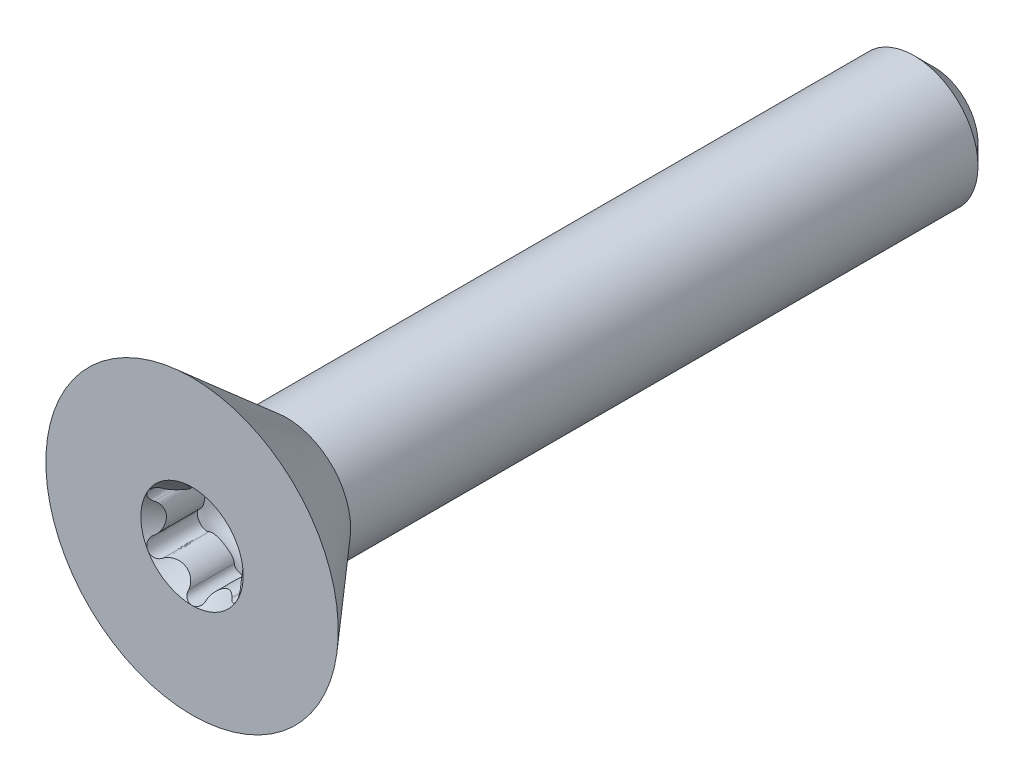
ISO-10303-21;
HEADER;
FILE_DESCRIPTION(('STEP AP214'),'2;1');
FILE_NAME('part.step','',(''),(''),'','','');
FILE_SCHEMA(('AUTOMOTIVE_DESIGN { 1 0 10303 214 1 1 1 1 }'));
ENDSEC;
DATA;
#1=APPLICATION_CONTEXT('core data for automotive mechanical design processes');
#2=APPLICATION_PROTOCOL_DEFINITION('international standard','automotive_design',2000,#1);
#3=PRODUCT_CONTEXT('',#1,'mechanical');
#4=PRODUCT('Part','Part','',(#3));
#5=PRODUCT_RELATED_PRODUCT_CATEGORY('part','',(#4));
#6=PRODUCT_DEFINITION_FORMATION('','',#4);
#7=PRODUCT_DEFINITION_CONTEXT('part definition',#1,'design');
#8=PRODUCT_DEFINITION('design','',#6,#7);
#9=PRODUCT_DEFINITION_SHAPE('','',#8);
#10=(LENGTH_UNIT() NAMED_UNIT(*) SI_UNIT(.MILLI.,.METRE.));
#11=(NAMED_UNIT(*) PLANE_ANGLE_UNIT() SI_UNIT($,.RADIAN.));
#12=(NAMED_UNIT(*) SI_UNIT($,.STERADIAN.) SOLID_ANGLE_UNIT());
#13=UNCERTAINTY_MEASURE_WITH_UNIT(LENGTH_MEASURE(1.E-05),#10,'distance_accuracy_value','');
#14=(GEOMETRIC_REPRESENTATION_CONTEXT(3) GLOBAL_UNCERTAINTY_ASSIGNED_CONTEXT((#13)) GLOBAL_UNIT_ASSIGNED_CONTEXT((#10,
#11,#12)) REPRESENTATION_CONTEXT('',''));
#15=CARTESIAN_POINT('',(0.,0.,0.));
#16=DIRECTION('',(0.,0.,1.));
#17=DIRECTION('',(1.,0.,0.));
#18=AXIS2_PLACEMENT_3D('',#15,#16,#17);
#19=CARTESIAN_POINT('',(0.,0.,-12.7));
#20=DIRECTION('',(0.,0.,1.));
#21=DIRECTION('',(1.,0.,0.));
#22=AXIS2_PLACEMENT_3D('',#19,#20,#21);
#23=CYLINDRICAL_SURFACE('',#22,1.0922);
#24=CARTESIAN_POINT('',(0.,0.,-1.62167434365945));
#25=DIRECTION('',(0.,0.,1.));
#26=DIRECTION('',(0.,-1.,0.));
#27=AXIS2_PLACEMENT_3D('',#24,#25,#26);
#28=CIRCLE('',#27,1.0922);
#29=CARTESIAN_POINT('',(0.,-1.0922,-1.62167434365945));
#30=VERTEX_POINT('',#29);
#31=EDGE_CURVE('E13',#30,#30,#28,.T.);
#32=ORIENTED_EDGE('',*,*,#31,.F.);
#33=EDGE_LOOP('',(#32));
#34=FACE_BOUND('',#33,.T.);
#35=CARTESIAN_POINT('',(0.,0.,-12.3562961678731));
#36=DIRECTION('',(0.,0.,1.));
#37=DIRECTION('',(1.,0.,0.));
#38=AXIS2_PLACEMENT_3D('',#35,#36,#37);
#39=CIRCLE('',#38,1.0922);
#40=CARTESIAN_POINT('',(1.0922,0.,-12.3562961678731));
#41=VERTEX_POINT('',#40);
#42=EDGE_CURVE('E342',#41,#41,#39,.T.);
#43=ORIENTED_EDGE('',*,*,#42,.T.);
#44=EDGE_LOOP('',(#43));
#45=FACE_BOUND('',#44,.T.);
#46=ADVANCED_FACE('F324',(#34,#45),#23,.T.);
#47=CARTESIAN_POINT('',(0.,0.,-12.7));
#48=DIRECTION('',(0.,0.,1.));
#49=DIRECTION('',(-1.,0.,0.));
#50=AXIS2_PLACEMENT_3D('',#47,#48,#49);
#51=CONICAL_SURFACE('',#50,0.748496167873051,0.78539816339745);
#52=ORIENTED_EDGE('',*,*,#42,.F.);
#53=EDGE_LOOP('',(#52));
#54=FACE_BOUND('',#53,.T.);
#55=CARTESIAN_POINT('',(0.,0.,-12.7));
#56=DIRECTION('',(0.,0.,-1.));
#57=DIRECTION('',(-1.,0.,0.));
#58=AXIS2_PLACEMENT_3D('',#55,#56,#57);
#59=CIRCLE('',#58,0.748496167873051);
#60=CARTESIAN_POINT('',(-0.748496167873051,0.,-12.7));
#61=VERTEX_POINT('',#60);
#62=EDGE_CURVE('E822',#61,#61,#59,.T.);
#63=ORIENTED_EDGE('',*,*,#62,.F.);
#64=EDGE_LOOP('',(#63));
#65=FACE_BOUND('',#64,.T.);
#66=ADVANCED_FACE('F802',(#54,#65),#51,.T.);
#67=CARTESIAN_POINT('',(0.,0.,-12.7));
#68=DIRECTION('',(0.,0.,1.));
#69=DIRECTION('',(1.,0.,0.));
#70=AXIS2_PLACEMENT_3D('',#67,#68,#69);
#71=PLANE('',#70);
#72=ORIENTED_EDGE('',*,*,#62,.T.);
#73=EDGE_LOOP('',(#72));
#74=FACE_BOUND('',#73,.T.);
#75=ADVANCED_FACE('F807',(#74),#71,.F.);
#76=CARTESIAN_POINT('',(0.,0.,-1.6256));
#77=DIRECTION('',(0.,0.,1.));
#78=DIRECTION('',(0.,-1.,0.));
#79=AXIS2_PLACEMENT_3D('',#76,#77,#78);
#80=CONICAL_SURFACE('',#79,1.08878747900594,0.715584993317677);
#81=ORIENTED_EDGE('',*,*,#31,.T.);
#82=EDGE_LOOP('',(#81));
#83=FACE_BOUND('',#82,.T.);
#84=CARTESIAN_POINT('',(0.,0.,0.));
#85=DIRECTION('',(0.,0.,-1.));
#86=DIRECTION('',(0.,1.,0.));
#87=AXIS2_PLACEMENT_3D('',#84,#85,#86);
#88=CIRCLE('',#87,2.5019);
#89=CARTESIAN_POINT('',(0.,2.5019,0.));
#90=VERTEX_POINT('',#89);
#91=EDGE_CURVE('E586',#90,#90,#88,.T.);
#92=ORIENTED_EDGE('',*,*,#91,.T.);
#93=EDGE_LOOP('',(#92));
#94=FACE_BOUND('',#93,.T.);
#95=ADVANCED_FACE('F664',(#83,#94),#80,.T.);
#96=CARTESIAN_POINT('',(0.,0.,0.));
#97=DIRECTION('',(0.,0.,1.));
#98=DIRECTION('',(1.,0.,0.));
#99=AXIS2_PLACEMENT_3D('',#96,#97,#98);
#100=PLANE('',#99);
#101=CARTESIAN_POINT('',(0.,0.,0.));
#102=DIRECTION('',(0.,0.,1.));
#103=DIRECTION('',(1.,0.,0.));
#104=AXIS2_PLACEMENT_3D('',#101,#102,#103);
#105=CIRCLE('',#104,0.8763);
#106=CARTESIAN_POINT('',(-0.758898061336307,0.438149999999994,0.));
#107=VERTEX_POINT('',#106);
#108=CARTESIAN_POINT('',(-0.758898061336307,-0.438149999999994,0.));
#109=VERTEX_POINT('',#108);
#110=EDGE_CURVE('E441',#107,#109,#105,.T.);
#111=ORIENTED_EDGE('',*,*,#110,.F.);
#112=CARTESIAN_POINT('',(0.,0.,0.));
#113=DIRECTION('',(0.,0.,1.));
#114=DIRECTION('',(1.,0.,0.));
#115=AXIS2_PLACEMENT_3D('',#112,#113,#114);
#116=CIRCLE('',#115,0.8763);
#117=CARTESIAN_POINT('',(0.,0.8763,0.));
#118=VERTEX_POINT('',#117);
#119=EDGE_CURVE('E1010',#118,#107,#116,.T.);
#120=ORIENTED_EDGE('',*,*,#119,.F.);
#121=CARTESIAN_POINT('',(0.,0.,0.));
#122=DIRECTION('',(0.,0.,1.));
#123=DIRECTION('',(1.,0.,0.));
#124=AXIS2_PLACEMENT_3D('',#121,#122,#123);
#125=CIRCLE('',#124,0.8763);
#126=CARTESIAN_POINT('',(0.758898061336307,0.438149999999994,0.));
#127=VERTEX_POINT('',#126);
#128=EDGE_CURVE('E1023',#127,#118,#125,.T.);
#129=ORIENTED_EDGE('',*,*,#128,.F.);
#130=CARTESIAN_POINT('',(0.,0.,0.));
#131=DIRECTION('',(0.,0.,1.));
#132=DIRECTION('',(1.,0.,0.));
#133=AXIS2_PLACEMENT_3D('',#130,#131,#132);
#134=CIRCLE('',#133,0.8763);
#135=CARTESIAN_POINT('',(0.758898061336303,-0.438150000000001,0.));
#136=VERTEX_POINT('',#135);
#137=EDGE_CURVE('E1062',#136,#127,#134,.T.);
#138=ORIENTED_EDGE('',*,*,#137,.F.);
#139=CARTESIAN_POINT('',(0.,0.,0.));
#140=DIRECTION('',(0.,0.,1.));
#141=DIRECTION('',(1.,0.,0.));
#142=AXIS2_PLACEMENT_3D('',#139,#140,#141);
#143=CIRCLE('',#142,0.8763);
#144=CARTESIAN_POINT('',(0.,-0.8763,0.));
#145=VERTEX_POINT('',#144);
#146=EDGE_CURVE('E475',#145,#136,#143,.T.);
#147=ORIENTED_EDGE('',*,*,#146,.F.);
#148=CARTESIAN_POINT('',(0.,0.,0.));
#149=DIRECTION('',(0.,0.,1.));
#150=DIRECTION('',(1.,0.,0.));
#151=AXIS2_PLACEMENT_3D('',#148,#149,#150);
#152=CIRCLE('',#151,0.8763);
#153=EDGE_CURVE('E464',#109,#145,#152,.T.);
#154=ORIENTED_EDGE('',*,*,#153,.F.);
#155=EDGE_LOOP('',(#111,#120,#129,#138,#147,#154));
#156=FACE_BOUND('',#155,.T.);
#157=ORIENTED_EDGE('',*,*,#91,.F.);
#158=EDGE_LOOP('',(#157));
#159=FACE_BOUND('',#158,.T.);
#160=ADVANCED_FACE('F471',(#156,#159),#100,.T.);
#161=CARTESIAN_POINT('',(-0.664035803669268,-0.383381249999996,-0.8763));
#162=DIRECTION('',(0.,0.,1.));
#163=DIRECTION('',(-0.499999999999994,0.866025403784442,0.));
#164=AXIS2_PLACEMENT_3D('',#161,#162,#163);
#165=ELLIPSE('',#164,0.153303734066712,0.1095375);
#166=DIRECTION('',(0.,0.,1.));
#167=VECTOR('',#166,1.);
#168=SURFACE_OF_LINEAR_EXTRUSION('',#165,#167);
#169=DIRECTION('',(0.,0.,1.));
#170=VECTOR('',#169,1.);
#171=CARTESIAN_POINT('',(-0.740687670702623,-0.250616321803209,-0.8763));
#172=LINE('',#171,#170);
#173=CARTESIAN_POINT('',(-0.740685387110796,-0.25061500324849,-0.875469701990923));
#174=VERTEX_POINT('',#173);
#175=CARTESIAN_POINT('',(-0.740687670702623,-0.250616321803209,-0.0943621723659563));
#176=VERTEX_POINT('',#175);
#177=EDGE_CURVE('E460',#174,#176,#172,.T.);
#178=ORIENTED_EDGE('',*,*,#177,.T.);
#179=CARTESIAN_POINT('',(-0.585602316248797,-0.515085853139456,-0.0964003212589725));
#180=CARTESIAN_POINT('',(-0.590577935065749,-0.518149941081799,-0.0906373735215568));
#181=CARTESIAN_POINT('',(-0.595964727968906,-0.520672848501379,-0.0849275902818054));
#182=CARTESIAN_POINT('',(-0.607403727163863,-0.524518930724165,-0.07377106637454));
#183=CARTESIAN_POINT('',(-0.613456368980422,-0.525841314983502,-0.0683245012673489));
#184=CARTESIAN_POINT('',(-0.626020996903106,-0.527160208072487,-0.0578941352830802));
#185=CARTESIAN_POINT('',(-0.632529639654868,-0.527165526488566,-0.0529074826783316));
#186=CARTESIAN_POINT('',(-0.645798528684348,-0.525844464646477,-0.0435062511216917));
#187=CARTESIAN_POINT('',(-0.652558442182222,-0.524519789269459,-0.0390909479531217));
#188=CARTESIAN_POINT('',(-0.67208180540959,-0.518819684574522,-0.0273282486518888));
#189=CARTESIAN_POINT('',(-0.68489961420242,-0.512786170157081,-0.0208147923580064));
#190=CARTESIAN_POINT('',(-0.709694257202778,-0.496637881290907,-0.0102078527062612));
#191=CARTESIAN_POINT('',(-0.721607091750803,-0.486351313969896,-0.00623675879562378));
#192=CARTESIAN_POINT('',(-0.744032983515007,-0.461747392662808,-0.000800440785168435));
#193=CARTESIAN_POINT('',(-0.754281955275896,-0.447127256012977,0.000370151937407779));
#194=CARTESIAN_POINT('',(-0.771509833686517,-0.414690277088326,-0.000609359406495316));
#195=CARTESIAN_POINT('',(-0.778178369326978,-0.396714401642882,-0.00302051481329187));
#196=CARTESIAN_POINT('',(-0.785879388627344,-0.360687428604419,-0.0117837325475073));
#197=CARTESIAN_POINT('',(-0.786989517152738,-0.342640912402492,-0.0180801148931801));
#198=CARTESIAN_POINT('',(-0.783324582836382,-0.310698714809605,-0.0337148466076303));
#199=CARTESIAN_POINT('',(-0.77911490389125,-0.296569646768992,-0.0426951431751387));
#200=CARTESIAN_POINT('',(-0.76692465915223,-0.273585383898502,-0.0620834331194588));
#201=CARTESIAN_POINT('',(-0.759297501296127,-0.26438241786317,-0.0723035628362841));
#202=CARTESIAN_POINT('',(-0.747375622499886,-0.254812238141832,-0.0866799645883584));
#203=CARTESIAN_POINT('',(-0.74408953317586,-0.252567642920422,-0.090512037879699));
#204=CARTESIAN_POINT('',(-0.740685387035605,-0.250615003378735,-0.0943647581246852));
#205=B_SPLINE_CURVE_WITH_KNOTS('',3,(#179,#180,#181,#182,#183,#184,#185,#186,#187,#188,#189,
#190,#191,#192,#193,#194,#195,#196,#197,#198,#199,#200,#201,#202,#203,#204),.UNSPECIFIED.,.F.,
.F.,(4,2,2,2,2,2,2,2,2,2,2,2,4),(0.,0.0246095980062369,0.0492353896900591,0.0736964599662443,
0.0981262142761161,0.144028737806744,0.192001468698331,0.244834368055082,0.301711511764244,
0.357791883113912,0.408383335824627,0.454646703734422,0.471177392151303),.UNSPECIFIED.);
#206=EDGE_CURVE('E444',#109,#176,#205,.T.);
#207=ORIENTED_EDGE('',*,*,#206,.F.);
#208=CARTESIAN_POINT('',(-0.585602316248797,-0.515085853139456,-0.0964003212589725));
#209=CARTESIAN_POINT('',(-0.590577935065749,-0.518149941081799,-0.0906373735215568));
#210=CARTESIAN_POINT('',(-0.595964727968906,-0.520672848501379,-0.0849275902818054));
#211=CARTESIAN_POINT('',(-0.607403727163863,-0.524518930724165,-0.07377106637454));
#212=CARTESIAN_POINT('',(-0.613456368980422,-0.525841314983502,-0.0683245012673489));
#213=CARTESIAN_POINT('',(-0.626020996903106,-0.527160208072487,-0.0578941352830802));
#214=CARTESIAN_POINT('',(-0.632529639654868,-0.527165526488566,-0.0529074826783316));
#215=CARTESIAN_POINT('',(-0.645798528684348,-0.525844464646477,-0.0435062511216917));
#216=CARTESIAN_POINT('',(-0.652558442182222,-0.524519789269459,-0.0390909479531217));
#217=CARTESIAN_POINT('',(-0.67208180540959,-0.518819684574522,-0.0273282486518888));
#218=CARTESIAN_POINT('',(-0.68489961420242,-0.512786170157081,-0.0208147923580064));
#219=CARTESIAN_POINT('',(-0.709694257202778,-0.496637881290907,-0.0102078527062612));
#220=CARTESIAN_POINT('',(-0.721607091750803,-0.486351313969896,-0.00623675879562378));
#221=CARTESIAN_POINT('',(-0.744032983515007,-0.461747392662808,-0.000800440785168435));
#222=CARTESIAN_POINT('',(-0.754281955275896,-0.447127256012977,0.000370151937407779));
#223=CARTESIAN_POINT('',(-0.771509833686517,-0.414690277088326,-0.000609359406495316));
#224=CARTESIAN_POINT('',(-0.778178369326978,-0.396714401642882,-0.00302051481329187));
#225=CARTESIAN_POINT('',(-0.785879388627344,-0.360687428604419,-0.0117837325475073));
#226=CARTESIAN_POINT('',(-0.786989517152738,-0.342640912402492,-0.0180801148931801));
#227=CARTESIAN_POINT('',(-0.783324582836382,-0.310698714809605,-0.0337148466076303));
#228=CARTESIAN_POINT('',(-0.77911490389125,-0.296569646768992,-0.0426951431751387));
#229=CARTESIAN_POINT('',(-0.76692465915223,-0.273585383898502,-0.0620834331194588));
#230=CARTESIAN_POINT('',(-0.759297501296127,-0.26438241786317,-0.0723035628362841));
#231=CARTESIAN_POINT('',(-0.747375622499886,-0.254812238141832,-0.0866799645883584));
#232=CARTESIAN_POINT('',(-0.74408953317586,-0.252567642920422,-0.090512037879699));
#233=CARTESIAN_POINT('',(-0.740685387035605,-0.250615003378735,-0.0943647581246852));
#234=B_SPLINE_CURVE_WITH_KNOTS('',3,(#208,#209,#210,#211,#212,#213,#214,#215,#216,#217,#218,
#219,#220,#221,#222,#223,#224,#225,#226,#227,#228,#229,#230,#231,#232,#233),.UNSPECIFIED.,.F.,
.F.,(4,2,2,2,2,2,2,2,2,2,2,2,4),(0.,0.0246095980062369,0.0492353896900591,0.0736964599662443,
0.0981262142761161,0.144028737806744,0.192001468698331,0.244834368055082,0.301711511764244,
0.357791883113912,0.408383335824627,0.454646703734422,0.471177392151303),.UNSPECIFIED.);
#235=CARTESIAN_POINT('',(-0.587383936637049,-0.516146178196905,-0.0943621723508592));
#236=VERTEX_POINT('',#235);
#237=EDGE_CURVE('E456',#236,#109,#234,.T.);
#238=ORIENTED_EDGE('',*,*,#237,.F.);
#239=DIRECTION('',(0.,0.,1.));
#240=VECTOR('',#239,1.);
#241=CARTESIAN_POINT('',(-0.587383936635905,-0.516146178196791,-0.8763));
#242=LINE('',#241,#240);
#243=CARTESIAN_POINT('',(-0.587383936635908,-0.516146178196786,-0.875921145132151));
#244=VERTEX_POINT('',#243);
#245=EDGE_CURVE('E591',#244,#236,#242,.T.);
#246=ORIENTED_EDGE('',*,*,#245,.F.);
#247=CARTESIAN_POINT('',(-0.740683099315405,-0.250613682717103,-0.875469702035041));
#248=CARTESIAN_POINT('',(-0.744740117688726,-0.252947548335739,-0.875409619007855));
#249=CARTESIAN_POINT('',(-0.748569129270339,-0.255651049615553,-0.875417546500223));
#250=CARTESIAN_POINT('',(-0.755676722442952,-0.261657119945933,-0.875516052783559));
#251=CARTESIAN_POINT('',(-0.758959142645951,-0.264955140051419,-0.875606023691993));
#252=CARTESIAN_POINT('',(-0.76790685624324,-0.275564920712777,-0.875919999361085));
#253=CARTESIAN_POINT('',(-0.772706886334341,-0.283613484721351,-0.876188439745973));
#254=CARTESIAN_POINT('',(-0.781605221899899,-0.304342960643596,-0.876676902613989));
#255=CARTESIAN_POINT('',(-0.784486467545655,-0.317514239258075,-0.87682486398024));
#256=CARTESIAN_POINT('',(-0.786987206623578,-0.349032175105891,-0.876868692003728));
#257=CARTESIAN_POINT('',(-0.784979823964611,-0.367468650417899,-0.876649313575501));
#258=CARTESIAN_POINT('',(-0.777670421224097,-0.396477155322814,-0.87640048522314));
#259=CARTESIAN_POINT('',(-0.773827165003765,-0.407476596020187,-0.876331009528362));
#260=CARTESIAN_POINT('',(-0.76439659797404,-0.428706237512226,-0.876310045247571));
#261=CARTESIAN_POINT('',(-0.758807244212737,-0.438935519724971,-0.876358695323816));
#262=CARTESIAN_POINT('',(-0.739571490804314,-0.468219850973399,-0.876663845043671));
#263=CARTESIAN_POINT('',(-0.723473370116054,-0.485812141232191,-0.877080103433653));
#264=CARTESIAN_POINT('',(-0.692208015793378,-0.508729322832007,-0.877235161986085));
#265=CARTESIAN_POINT('',(-0.678631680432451,-0.516192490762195,-0.877157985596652));
#266=CARTESIAN_POINT('',(-0.652939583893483,-0.524776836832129,-0.876644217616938));
#267=CARTESIAN_POINT('',(-0.641226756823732,-0.526974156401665,-0.876296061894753));
#268=CARTESIAN_POINT('',(-0.624744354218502,-0.527009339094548,-0.875844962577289));
#269=CARTESIAN_POINT('',(-0.619968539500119,-0.526657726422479,-0.875718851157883));
#270=CARTESIAN_POINT('',(-0.610544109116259,-0.525166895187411,-0.875519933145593));
#271=CARTESIAN_POINT('',(-0.60589524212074,-0.524029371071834,-0.875447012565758));
#272=CARTESIAN_POINT('',(-0.596523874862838,-0.520840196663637,-0.875396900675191));
#273=CARTESIAN_POINT('',(-0.591822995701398,-0.518725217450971,-0.8754274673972));
#274=CARTESIAN_POINT('',(-0.587376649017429,-0.516141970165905,-0.875542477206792));
#275=B_SPLINE_CURVE_WITH_KNOTS('',3,(#247,#248,#249,#250,#251,#252,#253,#254,#255,#256,#257,
#258,#259,#260,#261,#262,#263,#264,#265,#266,#267,#268,#269,#270,#271,#272,#273,#274),
.UNSPECIFIED.,.F.,.F.,(4,2,2,2,2,2,2,2,2,2,2,2,2,4),(0.,0.0139998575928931,0.027896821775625,
0.0555760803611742,0.0953157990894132,0.149947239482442,0.184767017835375,0.219627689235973,
0.289525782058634,0.335336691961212,0.37041547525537,0.384731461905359,0.399016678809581,
0.414395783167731),.UNSPECIFIED.);
#276=EDGE_CURVE('E574',#174,#244,#275,.T.);
#277=ORIENTED_EDGE('',*,*,#276,.F.);
#278=EDGE_LOOP('',(#178,#207,#238,#246,#277));
#279=FACE_BOUND('',#278,.T.);
#280=ADVANCED_FACE('F454',(#279),#168,.F.);
#281=CARTESIAN_POINT('',(-0.7667625,0.,-0.8763));
#282=DIRECTION('',(0.,0.,-1.));
#283=DIRECTION('',(0.,-1.,0.));
#284=AXIS2_PLACEMENT_3D('',#281,#282,#283);
#285=ELLIPSE('',#284,0.258033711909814,0.1095375);
#286=DIRECTION('',(0.,0.,1.));
#287=VECTOR('',#286,1.);
#288=SURFACE_OF_LINEAR_EXTRUSION('',#285,#287);
#289=DIRECTION('',(0.,0.,1.));
#290=VECTOR('',#289,1.);
#291=CARTESIAN_POINT('',(-0.740687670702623,0.250616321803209,-0.8763));
#292=LINE('',#291,#290);
#293=CARTESIAN_POINT('',(-0.740685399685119,0.250615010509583,-0.875467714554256));
#294=VERTEX_POINT('',#293);
#295=CARTESIAN_POINT('',(-0.740687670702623,0.250616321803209,-0.0943621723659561));
#296=VERTEX_POINT('',#295);
#297=EDGE_CURVE('E577',#294,#296,#292,.T.);
#298=ORIENTED_EDGE('',*,*,#297,.T.);
#299=CARTESIAN_POINT('',(-0.742389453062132,-0.251564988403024,-0.0924460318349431));
#300=CARTESIAN_POINT('',(-0.737431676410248,-0.248878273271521,-0.0980024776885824));
#301=CARTESIAN_POINT('',(-0.732792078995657,-0.245550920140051,-0.103464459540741));
#302=CARTESIAN_POINT('',(-0.724108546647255,-0.237920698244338,-0.114109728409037));
#303=CARTESIAN_POINT('',(-0.720060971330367,-0.233624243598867,-0.119294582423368));
#304=CARTESIAN_POINT('',(-0.709918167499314,-0.221210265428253,-0.132735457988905));
#305=CARTESIAN_POINT('',(-0.704262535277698,-0.212458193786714,-0.140727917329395));
#306=CARTESIAN_POINT('',(-0.694078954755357,-0.193641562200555,-0.155755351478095));
#307=CARTESIAN_POINT('',(-0.689549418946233,-0.183578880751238,-0.162791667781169));
#308=CARTESIAN_POINT('',(-0.681446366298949,-0.162456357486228,-0.175817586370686));
#309=CARTESIAN_POINT('',(-0.677872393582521,-0.15139699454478,-0.181807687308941));
#310=CARTESIAN_POINT('',(-0.67072958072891,-0.125329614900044,-0.194094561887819));
#311=CARTESIAN_POINT('',(-0.667431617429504,-0.110071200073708,-0.200023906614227));
#312=CARTESIAN_POINT('',(-0.662264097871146,-0.0790804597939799,-0.209494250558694));
#313=CARTESIAN_POINT('',(-0.660356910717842,-0.0633736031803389,-0.213097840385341));
#314=CARTESIAN_POINT('',(-0.657868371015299,-0.0320218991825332,-0.21782977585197));
#315=CARTESIAN_POINT('',(-0.657244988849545,-0.0163923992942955,-0.219036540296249));
#316=CARTESIAN_POINT('',(-0.657205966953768,0.0148679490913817,-0.219111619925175));
#317=CARTESIAN_POINT('',(-0.657789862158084,0.0304987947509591,-0.21798083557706));
#318=CARTESIAN_POINT('',(-0.660156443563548,0.0613323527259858,-0.213477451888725));
#319=CARTESIAN_POINT('',(-0.661938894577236,0.076535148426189,-0.210105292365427));
#320=CARTESIAN_POINT('',(-0.66669641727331,0.106147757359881,-0.201359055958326));
#321=CARTESIAN_POINT('',(-0.669671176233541,0.120557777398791,-0.195985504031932));
#322=CARTESIAN_POINT('',(-0.676852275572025,0.148280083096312,-0.183516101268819));
#323=CARTESIAN_POINT('',(-0.6810585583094,0.161592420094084,-0.176420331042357));
#324=CARTESIAN_POINT('',(-0.690648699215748,0.186288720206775,-0.161046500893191));
#325=CARTESIAN_POINT('',(-0.695979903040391,0.197727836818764,-0.152825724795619));
#326=CARTESIAN_POINT('',(-0.70609928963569,0.21516945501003,-0.13816476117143));
#327=CARTESIAN_POINT('',(-0.710461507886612,0.221702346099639,-0.132062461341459));
#328=CARTESIAN_POINT('',(-0.719142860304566,0.232612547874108,-0.120480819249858));
#329=CARTESIAN_POINT('',(-0.723336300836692,0.237167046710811,-0.115078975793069));
#330=CARTESIAN_POINT('',(-0.732364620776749,0.245240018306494,-0.103969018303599));
#331=CARTESIAN_POINT('',(-0.737203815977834,0.248750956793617,-0.098259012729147));
#332=CARTESIAN_POINT('',(-0.742389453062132,0.251564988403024,-0.0924460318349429));
#333=B_SPLINE_CURVE_WITH_KNOTS('',3,(#299,#300,#301,#302,#303,#304,#305,#306,#307,#308,#309,
#310,#311,#312,#313,#314,#315,#316,#317,#318,#319,#320,#321,#322,#323,#324,#325,#326,#327,#328,
#329,#330,#331,#332),.UNSPECIFIED.,.F.,.F.,(4,2,2,2,2,2,2,2,2,2,2,2,2,2,2,2,4),(0.,
0.0236460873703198,0.0471400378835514,0.0863370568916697,0.125478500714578,0.164601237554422,
0.214466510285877,0.262926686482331,0.309773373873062,0.356602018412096,0.403421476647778,
0.450228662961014,0.497033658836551,0.542002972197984,0.571766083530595,0.596327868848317,
0.621062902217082),.UNSPECIFIED.);
#334=EDGE_CURVE('E350',#176,#296,#333,.T.);
#335=ORIENTED_EDGE('',*,*,#334,.F.);
#336=ORIENTED_EDGE('',*,*,#177,.F.);
#337=CARTESIAN_POINT('',(-0.740683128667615,0.250613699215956,-0.87546771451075));
#338=CARTESIAN_POINT('',(-0.737250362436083,0.248625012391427,-0.875518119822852));
#339=CARTESIAN_POINT('',(-0.734011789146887,0.246347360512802,-0.875565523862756));
#340=CARTESIAN_POINT('',(-0.727916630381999,0.241382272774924,-0.875652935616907));
#341=CARTESIAN_POINT('',(-0.725056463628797,0.238699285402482,-0.875693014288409));
#342=CARTESIAN_POINT('',(-0.717045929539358,0.230332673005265,-0.87580020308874));
#343=CARTESIAN_POINT('',(-0.712330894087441,0.224239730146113,-0.87585635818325));
#344=CARTESIAN_POINT('',(-0.703765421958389,0.211426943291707,-0.875951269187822));
#345=CARTESIAN_POINT('',(-0.699923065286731,0.204701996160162,-0.875989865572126));
#346=CARTESIAN_POINT('',(-0.688943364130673,0.183060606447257,-0.876107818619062));
#347=CARTESIAN_POINT('',(-0.68303131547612,0.167530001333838,-0.876183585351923));
#348=CARTESIAN_POINT('',(-0.673278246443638,0.135871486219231,-0.8763764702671));
#349=CARTESIAN_POINT('',(-0.669440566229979,0.1197426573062,-0.876493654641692));
#350=CARTESIAN_POINT('',(-0.663488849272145,0.0877074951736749,-0.87672190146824));
#351=CARTESIAN_POINT('',(-0.66132345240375,0.0718106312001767,-0.876833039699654));
#352=CARTESIAN_POINT('',(-0.658318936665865,0.0398808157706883,-0.876999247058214));
#353=CARTESIAN_POINT('',(-0.657481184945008,0.0238477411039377,-0.877054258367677));
#354=CARTESIAN_POINT('',(-0.657069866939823,-0.00817478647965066,-0.877080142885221));
#355=CARTESIAN_POINT('',(-0.657491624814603,-0.0241641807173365,-0.877051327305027));
#356=CARTESIAN_POINT('',(-0.659621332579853,-0.0560559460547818,-0.876924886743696));
#357=CARTESIAN_POINT('',(-0.661328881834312,-0.0719583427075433,-0.87682728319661));
#358=CARTESIAN_POINT('',(-0.665609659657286,-0.0998393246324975,-0.876636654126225));
#359=CARTESIAN_POINT('',(-0.667885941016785,-0.111863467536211,-0.876547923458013));
#360=CARTESIAN_POINT('',(-0.673429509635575,-0.135754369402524,-0.876381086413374));
#361=CARTESIAN_POINT('',(-0.676701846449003,-0.147619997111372,-0.876303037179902));
#362=CARTESIAN_POINT('',(-0.684523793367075,-0.17110770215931,-0.87616684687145));
#363=CARTESIAN_POINT('',(-0.689090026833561,-0.182724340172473,-0.876108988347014));
#364=CARTESIAN_POINT('',(-0.699874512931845,-0.205039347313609,-0.875992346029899));
#365=CARTESIAN_POINT('',(-0.70606922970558,-0.215748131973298,-0.875933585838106));
#366=CARTESIAN_POINT('',(-0.717270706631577,-0.230411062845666,-0.875799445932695));
#367=CARTESIAN_POINT('',(-0.721319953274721,-0.235063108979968,-0.875747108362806));
#368=CARTESIAN_POINT('',(-0.730297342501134,-0.24357752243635,-0.875623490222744));
#369=CARTESIAN_POINT('',(-0.735239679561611,-0.247424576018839,-0.875551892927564));
#370=CARTESIAN_POINT('',(-0.740683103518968,-0.25061368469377,-0.875469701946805));
#371=B_SPLINE_CURVE_WITH_KNOTS('',3,(#337,#338,#339,#340,#341,#342,#343,#344,#345,#346,#347,
#348,#349,#350,#351,#352,#353,#354,#355,#356,#357,#358,#359,#360,#361,#362,#363,#364,#365,#366,
#367,#368,#369,#370),.UNSPECIFIED.,.F.,.F.,(4,2,2,2,2,2,2,2,2,2,2,2,2,2,2,2,4),(0.,
0.0118534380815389,0.0235851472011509,0.0465719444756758,0.0697636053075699,0.11934299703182,
0.169001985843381,0.217067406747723,0.265182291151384,0.313118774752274,0.361040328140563,
0.397722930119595,0.434594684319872,0.471963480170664,0.508819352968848,0.527226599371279,
0.545957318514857),.UNSPECIFIED.);
#372=EDGE_CURVE('E581',#294,#174,#371,.T.);
#373=ORIENTED_EDGE('',*,*,#372,.F.);
#374=EDGE_LOOP('',(#298,#335,#336,#373));
#375=FACE_BOUND('',#374,.T.);
#376=ADVANCED_FACE('F646',(#375),#288,.F.);
#377=CARTESIAN_POINT('',(-0.664035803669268,0.383381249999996,-0.8763));
#378=DIRECTION('',(0.,0.,1.));
#379=DIRECTION('',(-0.499999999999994,-0.866025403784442,0.));
#380=AXIS2_PLACEMENT_3D('',#377,#378,#379);
#381=ELLIPSE('',#380,0.153303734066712,0.1095375);
#382=DIRECTION('',(0.,0.,1.));
#383=VECTOR('',#382,1.);
#384=SURFACE_OF_LINEAR_EXTRUSION('',#381,#383);
#385=CARTESIAN_POINT('',(-0.740685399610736,0.250615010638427,-0.0943647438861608));
#386=CARTESIAN_POINT('',(-0.745740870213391,0.253520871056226,-0.0886415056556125));
#387=CARTESIAN_POINT('',(-0.750524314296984,0.257047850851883,-0.0829805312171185));
#388=CARTESIAN_POINT('',(-0.759354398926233,0.265245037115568,-0.071957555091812));
#389=CARTESIAN_POINT('',(-0.763403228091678,0.269911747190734,-0.0665946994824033));
#390=CARTESIAN_POINT('',(-0.770529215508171,0.280199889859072,-0.0564128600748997));
#391=CARTESIAN_POINT('',(-0.773624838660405,0.285799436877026,-0.0515848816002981));
#392=CARTESIAN_POINT('',(-0.778700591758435,0.297532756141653,-0.0427055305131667));
#393=CARTESIAN_POINT('',(-0.780728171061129,0.303626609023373,-0.0386276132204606));
#394=CARTESIAN_POINT('',(-0.785393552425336,0.322945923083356,-0.0271695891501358));
#395=CARTESIAN_POINT('',(-0.786544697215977,0.337106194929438,-0.0206633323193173));
#396=CARTESIAN_POINT('',(-0.785323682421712,0.359016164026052,-0.0128330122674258));
#397=CARTESIAN_POINT('',(-0.784382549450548,0.36656528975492,-0.0105227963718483));
#398=CARTESIAN_POINT('',(-0.781526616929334,0.381666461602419,-0.00658814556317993));
#399=CARTESIAN_POINT('',(-0.779612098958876,0.389218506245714,-0.00496351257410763));
#400=CARTESIAN_POINT('',(-0.774881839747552,0.404139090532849,-0.00239504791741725));
#401=CARTESIAN_POINT('',(-0.772066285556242,0.411507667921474,-0.00145107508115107));
#402=CARTESIAN_POINT('',(-0.762299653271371,0.43328280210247,0.00039029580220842));
#403=CARTESIAN_POINT('',(-0.75405142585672,0.447242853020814,0.000268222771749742));
#404=CARTESIAN_POINT('',(-0.738777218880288,0.467491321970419,-0.00208635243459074));
#405=CARTESIAN_POINT('',(-0.732627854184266,0.474584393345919,-0.00343657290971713));
#406=CARTESIAN_POINT('',(-0.72000369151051,0.487230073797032,-0.00697373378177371));
#407=CARTESIAN_POINT('',(-0.713585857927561,0.492857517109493,-0.00909202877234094));
#408=CARTESIAN_POINT('',(-0.700574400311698,0.502730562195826,-0.0140442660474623));
#409=CARTESIAN_POINT('',(-0.694007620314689,0.507033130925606,-0.0168348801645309));
#410=CARTESIAN_POINT('',(-0.680903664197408,0.514295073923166,-0.0230210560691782));
#411=CARTESIAN_POINT('',(-0.674380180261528,0.517308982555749,-0.0263811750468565));
#412=CARTESIAN_POINT('',(-0.661385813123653,0.522116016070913,-0.0336837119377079));
#413=CARTESIAN_POINT('',(-0.654916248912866,0.523931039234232,-0.0376139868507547));
#414=CARTESIAN_POINT('',(-0.642114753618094,0.526363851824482,-0.0460316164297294));
#415=CARTESIAN_POINT('',(-0.635782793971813,0.526981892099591,-0.0505188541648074));
#416=CARTESIAN_POINT('',(-0.623589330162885,0.527015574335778,-0.0598482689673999));
#417=CARTESIAN_POINT('',(-0.617720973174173,0.526454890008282,-0.0646816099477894));
#418=CARTESIAN_POINT('',(-0.60244679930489,0.523462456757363,-0.0782184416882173));
#419=CARTESIAN_POINT('',(-0.593499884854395,0.519982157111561,-0.0872255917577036));
#420=CARTESIAN_POINT('',(-0.58560238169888,0.515085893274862,-0.0964002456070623));
#421=B_SPLINE_CURVE_WITH_KNOTS('',3,(#385,#386,#387,#388,#389,#390,#391,#392,#393,#394,#395,
#396,#397,#398,#399,#400,#401,#402,#403,#404,#405,#406,#407,#408,#409,#410,#411,#412,#413,#414,
#415,#416,#417,#418,#419,#420),.UNSPECIFIED.,.F.,.F.,(4,2,2,2,2,2,2,2,2,2,2,2,2,2,2,2,2,4),(0.,
0.0244980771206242,0.0489219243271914,0.0728375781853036,0.0955747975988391,0.141501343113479,
0.165286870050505,0.189065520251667,0.212839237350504,0.260739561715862,0.289076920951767,
0.315335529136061,0.340217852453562,0.363906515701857,0.38714955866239,0.410387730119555,
0.43316364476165,0.47216850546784),.UNSPECIFIED.);
#422=CARTESIAN_POINT('',(-0.587383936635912,0.516146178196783,-0.0943621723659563));
#423=VERTEX_POINT('',#422);
#424=EDGE_CURVE('E358',#107,#423,#421,.T.);
#425=ORIENTED_EDGE('',*,*,#424,.F.);
#426=CARTESIAN_POINT('',(-0.740685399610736,0.250615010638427,-0.0943647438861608));
#427=CARTESIAN_POINT('',(-0.745740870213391,0.253520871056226,-0.0886415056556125));
#428=CARTESIAN_POINT('',(-0.750524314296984,0.257047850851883,-0.0829805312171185));
#429=CARTESIAN_POINT('',(-0.759354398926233,0.265245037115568,-0.071957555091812));
#430=CARTESIAN_POINT('',(-0.763403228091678,0.269911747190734,-0.0665946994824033));
#431=CARTESIAN_POINT('',(-0.770529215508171,0.280199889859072,-0.0564128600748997));
#432=CARTESIAN_POINT('',(-0.773624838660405,0.285799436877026,-0.0515848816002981));
#433=CARTESIAN_POINT('',(-0.778700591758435,0.297532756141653,-0.0427055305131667));
#434=CARTESIAN_POINT('',(-0.780728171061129,0.303626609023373,-0.0386276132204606));
#435=CARTESIAN_POINT('',(-0.785393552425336,0.322945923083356,-0.0271695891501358));
#436=CARTESIAN_POINT('',(-0.786544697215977,0.337106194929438,-0.0206633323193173));
#437=CARTESIAN_POINT('',(-0.785323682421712,0.359016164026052,-0.0128330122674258));
#438=CARTESIAN_POINT('',(-0.784382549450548,0.36656528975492,-0.0105227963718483));
#439=CARTESIAN_POINT('',(-0.781526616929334,0.381666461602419,-0.00658814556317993));
#440=CARTESIAN_POINT('',(-0.779612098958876,0.389218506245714,-0.00496351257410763));
#441=CARTESIAN_POINT('',(-0.774881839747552,0.404139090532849,-0.00239504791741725));
#442=CARTESIAN_POINT('',(-0.772066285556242,0.411507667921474,-0.00145107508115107));
#443=CARTESIAN_POINT('',(-0.762299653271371,0.43328280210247,0.00039029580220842));
#444=CARTESIAN_POINT('',(-0.75405142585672,0.447242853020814,0.000268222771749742));
#445=CARTESIAN_POINT('',(-0.738777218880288,0.467491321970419,-0.00208635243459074));
#446=CARTESIAN_POINT('',(-0.732627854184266,0.474584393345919,-0.00343657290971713));
#447=CARTESIAN_POINT('',(-0.72000369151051,0.487230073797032,-0.00697373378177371));
#448=CARTESIAN_POINT('',(-0.713585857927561,0.492857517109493,-0.00909202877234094));
#449=CARTESIAN_POINT('',(-0.700574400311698,0.502730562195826,-0.0140442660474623));
#450=CARTESIAN_POINT('',(-0.694007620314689,0.507033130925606,-0.0168348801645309));
#451=CARTESIAN_POINT('',(-0.680903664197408,0.514295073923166,-0.0230210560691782));
#452=CARTESIAN_POINT('',(-0.674380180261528,0.517308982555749,-0.0263811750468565));
#453=CARTESIAN_POINT('',(-0.661385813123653,0.522116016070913,-0.0336837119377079));
#454=CARTESIAN_POINT('',(-0.654916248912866,0.523931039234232,-0.0376139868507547));
#455=CARTESIAN_POINT('',(-0.642114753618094,0.526363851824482,-0.0460316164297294));
#456=CARTESIAN_POINT('',(-0.635782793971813,0.526981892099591,-0.0505188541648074));
#457=CARTESIAN_POINT('',(-0.623589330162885,0.527015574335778,-0.0598482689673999));
#458=CARTESIAN_POINT('',(-0.617720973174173,0.526454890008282,-0.0646816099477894));
#459=CARTESIAN_POINT('',(-0.60244679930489,0.523462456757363,-0.0782184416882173));
#460=CARTESIAN_POINT('',(-0.593499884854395,0.519982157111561,-0.0872255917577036));
#461=CARTESIAN_POINT('',(-0.58560238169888,0.515085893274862,-0.0964002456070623));
#462=B_SPLINE_CURVE_WITH_KNOTS('',3,(#426,#427,#428,#429,#430,#431,#432,#433,#434,#435,#436,
#437,#438,#439,#440,#441,#442,#443,#444,#445,#446,#447,#448,#449,#450,#451,#452,#453,#454,#455,
#456,#457,#458,#459,#460,#461),.UNSPECIFIED.,.F.,.F.,(4,2,2,2,2,2,2,2,2,2,2,2,2,2,2,2,2,4),(0.,
0.0244980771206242,0.0489219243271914,0.0728375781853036,0.0955747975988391,0.141501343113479,
0.165286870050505,0.189065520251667,0.212839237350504,0.260739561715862,0.289076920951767,
0.315335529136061,0.340217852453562,0.363906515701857,0.38714955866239,0.410387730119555,
0.43316364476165,0.47216850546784),.UNSPECIFIED.);
#463=EDGE_CURVE('E445',#296,#107,#462,.T.);
#464=ORIENTED_EDGE('',*,*,#463,.F.);
#465=ORIENTED_EDGE('',*,*,#297,.F.);
#466=CARTESIAN_POINT('',(-0.587376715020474,0.516142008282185,-0.875541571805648));
#467=CARTESIAN_POINT('',(-0.591418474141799,0.518484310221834,-0.875437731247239));
#468=CARTESIAN_POINT('',(-0.595666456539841,0.520446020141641,-0.875404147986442));
#469=CARTESIAN_POINT('',(-0.604405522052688,0.523595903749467,-0.875434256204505));
#470=CARTESIAN_POINT('',(-0.608894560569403,0.524789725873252,-0.875497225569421));
#471=CARTESIAN_POINT('',(-0.622531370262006,0.527237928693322,-0.875766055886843));
#472=CARTESIAN_POINT('',(-0.63188385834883,0.527377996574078,-0.876051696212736));
#473=CARTESIAN_POINT('',(-0.654269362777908,0.524743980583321,-0.876672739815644));
#474=CARTESIAN_POINT('',(-0.667118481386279,0.520665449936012,-0.876975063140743));
#475=CARTESIAN_POINT('',(-0.695632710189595,0.507111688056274,-0.87729730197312));
#476=CARTESIAN_POINT('',(-0.710572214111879,0.496195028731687,-0.877170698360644));
#477=CARTESIAN_POINT('',(-0.732034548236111,0.475419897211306,-0.876841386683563));
#478=CARTESIAN_POINT('',(-0.739649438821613,0.46660043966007,-0.8766826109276));
#479=CARTESIAN_POINT('',(-0.753351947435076,0.447814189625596,-0.876436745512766));
#480=CARTESIAN_POINT('',(-0.759437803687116,0.437846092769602,-0.876349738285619));
#481=CARTESIAN_POINT('',(-0.769956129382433,0.416976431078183,-0.876300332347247));
#482=CARTESIAN_POINT('',(-0.774375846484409,0.406068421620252,-0.876338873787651));
#483=CARTESIAN_POINT('',(-0.78124640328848,0.383673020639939,-0.876498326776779));
#484=CARTESIAN_POINT('',(-0.783700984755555,0.372186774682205,-0.876619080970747));
#485=CARTESIAN_POINT('',(-0.786674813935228,0.345285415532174,-0.876834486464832));
#486=CARTESIAN_POINT('',(-0.786364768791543,0.32975016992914,-0.876909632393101));
#487=CARTESIAN_POINT('',(-0.780969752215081,0.303168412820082,-0.876649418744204));
#488=CARTESIAN_POINT('',(-0.777026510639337,0.29192641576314,-0.876406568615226));
#489=CARTESIAN_POINT('',(-0.768826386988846,0.277617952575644,-0.875995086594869));
#490=CARTESIAN_POINT('',(-0.766131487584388,0.273645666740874,-0.875867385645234));
#491=CARTESIAN_POINT('',(-0.760120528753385,0.266207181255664,-0.875640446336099));
#492=CARTESIAN_POINT('',(-0.756805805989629,0.262739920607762,-0.875541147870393));
#493=CARTESIAN_POINT('',(-0.749344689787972,0.256200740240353,-0.87541939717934));
#494=CARTESIAN_POINT('',(-0.745154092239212,0.253179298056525,-0.875403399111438));
#495=CARTESIAN_POINT('',(-0.740683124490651,0.250613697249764,-0.875467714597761));
#496=B_SPLINE_CURVE_WITH_KNOTS('',3,(#466,#467,#468,#469,#470,#471,#472,#473,#474,#475,#476,
#477,#478,#479,#480,#481,#482,#483,#484,#485,#486,#487,#488,#489,#490,#491,#492,#493,#494,#495),
.UNSPECIFIED.,.F.,.F.,(4,2,2,2,2,2,2,2,2,2,2,2,2,2,4),(0.,0.0139755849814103,0.0278471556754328,
0.0554768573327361,0.0952190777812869,0.149716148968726,0.184552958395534,0.219429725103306,
0.254568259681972,0.289639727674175,0.335516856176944,0.370589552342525,0.384939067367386,
0.399257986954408,0.414671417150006),.UNSPECIFIED.);
#497=CARTESIAN_POINT('',(-0.587383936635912,0.516146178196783,-0.875920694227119));
#498=VERTEX_POINT('',#497);
#499=EDGE_CURVE('E672',#498,#294,#496,.T.);
#500=ORIENTED_EDGE('',*,*,#499,.F.);
#501=DIRECTION('',(0.,0.,1.));
#502=VECTOR('',#501,1.);
#503=CARTESIAN_POINT('',(-0.587383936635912,0.516146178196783,-0.8763));
#504=LINE('',#503,#502);
#505=EDGE_CURVE('E564',#498,#423,#504,.T.);
#506=ORIENTED_EDGE('',*,*,#505,.T.);
#507=EDGE_LOOP('',(#425,#464,#465,#500,#506));
#508=FACE_BOUND('',#507,.T.);
#509=ADVANCED_FACE('F641',(#508),#384,.F.);
#510=CARTESIAN_POINT('',(0.,-0.7667625,-0.8763));
#511=DIRECTION('',(0.,0.,1.));
#512=DIRECTION('',(-1.,0.,0.));
#513=AXIS2_PLACEMENT_3D('',#510,#511,#512);
#514=ELLIPSE('',#513,0.153303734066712,0.1095375);
#515=DIRECTION('',(0.,0.,1.));
#516=VECTOR('',#515,1.);
#517=SURFACE_OF_LINEAR_EXTRUSION('',#514,#516);
#518=CARTESIAN_POINT('',(0.153276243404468,-0.764688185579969,-0.09640152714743));
#519=CARTESIAN_POINT('',(0.153442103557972,-0.770529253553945,-0.0906385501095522));
#520=CARTESIAN_POINT('',(0.152933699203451,-0.776455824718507,-0.0849287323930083));
#521=CARTESIAN_POINT('',(0.150545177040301,-0.788285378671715,-0.0737721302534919));
#522=CARTESIAN_POINT('',(0.148664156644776,-0.794188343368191,-0.0683255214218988));
#523=CARTESIAN_POINT('',(0.143524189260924,-0.805729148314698,-0.0578950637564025));
#524=CARTESIAN_POINT('',(0.140274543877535,-0.811368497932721,-0.0529083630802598));
#525=CARTESIAN_POINT('',(0.132496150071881,-0.822199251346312,-0.0435070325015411));
#526=CARTESIAN_POINT('',(0.127969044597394,-0.827391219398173,-0.0390916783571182));
#527=CARTESIAN_POINT('',(0.113271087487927,-0.841449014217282,-0.0273288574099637));
#528=CARTESIAN_POINT('',(0.101637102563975,-0.849532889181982,-0.0208153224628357));
#529=CARTESIAN_POINT('',(0.0752551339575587,-0.862931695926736,-0.0102082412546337));
#530=CARTESIAN_POINT('',(0.0603903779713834,-0.868105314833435,-0.00623707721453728));
#531=CARTESIAN_POINT('',(0.0278699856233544,-0.875224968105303,-0.00080058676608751));
#532=CARTESIAN_POINT('',(0.0100841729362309,-0.876790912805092,0.000370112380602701));
#533=CARTESIAN_POINT('',(-0.0266209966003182,-0.875492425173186,-0.000609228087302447));
#534=CARTESIAN_POINT('',(-0.0455229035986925,-0.872279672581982,-0.00302032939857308));
#535=CARTESIAN_POINT('',(-0.0805736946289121,-0.860935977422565,-0.0117831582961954));
#536=CARTESIAN_POINT('',(-0.0967574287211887,-0.85287454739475,-0.0180792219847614));
#537=CARTESIAN_POINT('',(-0.122588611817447,-0.833728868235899,-0.0337143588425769));
#538=CARTESIAN_POINT('',(-0.132720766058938,-0.823017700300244,-0.0426952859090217));
#539=CARTESIAN_POINT('',(-0.146529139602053,-0.800971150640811,-0.0620816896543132));
#540=CARTESIAN_POINT('',(-0.150683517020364,-0.789767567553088,-0.0722995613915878));
#541=CARTESIAN_POINT('',(-0.153122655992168,-0.773953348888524,-0.0873445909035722));
#542=CARTESIAN_POINT('',(-0.153414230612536,-0.769287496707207,-0.0918612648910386));
#543=CARTESIAN_POINT('',(-0.15327624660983,-0.764688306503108,-0.0964014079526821));
#544=B_SPLINE_CURVE_WITH_KNOTS('',3,(#518,#519,#520,#521,#522,#523,#524,#525,#526,#527,#528,
#529,#530,#531,#532,#533,#534,#535,#536,#537,#538,#539,#540,#541,#542,#543),.UNSPECIFIED.,.F.,
.F.,(4,2,2,2,2,2,2,2,2,2,2,2,4),(0.,0.0246096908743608,0.0492355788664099,0.0736967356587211,
0.0981265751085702,0.144029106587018,0.192001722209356,0.244834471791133,0.30171155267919,
0.357792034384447,0.408383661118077,0.454647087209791,0.47407911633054),.UNSPECIFIED.);
#545=CARTESIAN_POINT('',(-0.153303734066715,-0.766762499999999,-0.0943621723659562));
#546=VERTEX_POINT('',#545);
#547=EDGE_CURVE('E468',#145,#546,#544,.T.);
#548=ORIENTED_EDGE('',*,*,#547,.F.);
#549=CARTESIAN_POINT('',(0.153276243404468,-0.764688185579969,-0.09640152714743));
#550=CARTESIAN_POINT('',(0.153442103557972,-0.770529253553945,-0.0906385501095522));
#551=CARTESIAN_POINT('',(0.152933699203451,-0.776455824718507,-0.0849287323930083));
#552=CARTESIAN_POINT('',(0.150545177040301,-0.788285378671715,-0.0737721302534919));
#553=CARTESIAN_POINT('',(0.148664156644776,-0.794188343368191,-0.0683255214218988));
#554=CARTESIAN_POINT('',(0.143524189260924,-0.805729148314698,-0.0578950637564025));
#555=CARTESIAN_POINT('',(0.140274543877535,-0.811368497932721,-0.0529083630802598));
#556=CARTESIAN_POINT('',(0.132496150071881,-0.822199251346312,-0.0435070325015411));
#557=CARTESIAN_POINT('',(0.127969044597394,-0.827391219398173,-0.0390916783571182));
#558=CARTESIAN_POINT('',(0.113271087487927,-0.841449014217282,-0.0273288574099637));
#559=CARTESIAN_POINT('',(0.101637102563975,-0.849532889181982,-0.0208153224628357));
#560=CARTESIAN_POINT('',(0.0752551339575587,-0.862931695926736,-0.0102082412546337));
#561=CARTESIAN_POINT('',(0.0603903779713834,-0.868105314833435,-0.00623707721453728));
#562=CARTESIAN_POINT('',(0.0278699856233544,-0.875224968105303,-0.00080058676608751));
#563=CARTESIAN_POINT('',(0.0100841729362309,-0.876790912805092,0.000370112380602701));
#564=CARTESIAN_POINT('',(-0.0266209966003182,-0.875492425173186,-0.000609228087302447));
#565=CARTESIAN_POINT('',(-0.0455229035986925,-0.872279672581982,-0.00302032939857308));
#566=CARTESIAN_POINT('',(-0.0805736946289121,-0.860935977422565,-0.0117831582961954));
#567=CARTESIAN_POINT('',(-0.0967574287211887,-0.85287454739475,-0.0180792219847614));
#568=CARTESIAN_POINT('',(-0.122588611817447,-0.833728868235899,-0.0337143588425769));
#569=CARTESIAN_POINT('',(-0.132720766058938,-0.823017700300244,-0.0426952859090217));
#570=CARTESIAN_POINT('',(-0.146529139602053,-0.800971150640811,-0.0620816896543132));
#571=CARTESIAN_POINT('',(-0.150683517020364,-0.789767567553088,-0.0722995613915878));
#572=CARTESIAN_POINT('',(-0.153122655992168,-0.773953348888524,-0.0873445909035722));
#573=CARTESIAN_POINT('',(-0.153414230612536,-0.769287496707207,-0.0918612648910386));
#574=CARTESIAN_POINT('',(-0.15327624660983,-0.764688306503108,-0.0964014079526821));
#575=B_SPLINE_CURVE_WITH_KNOTS('',3,(#549,#550,#551,#552,#553,#554,#555,#556,#557,#558,#559,
#560,#561,#562,#563,#564,#565,#566,#567,#568,#569,#570,#571,#572,#573,#574),.UNSPECIFIED.,.F.,
.F.,(4,2,2,2,2,2,2,2,2,2,2,2,4),(0.,0.0246096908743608,0.0492355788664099,0.0736967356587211,
0.0981265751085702,0.144029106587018,0.192001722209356,0.244834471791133,0.30171155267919,
0.357792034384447,0.408383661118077,0.454647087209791,0.47407911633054),.UNSPECIFIED.);
#576=CARTESIAN_POINT('',(0.153303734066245,-0.766762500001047,-0.0943621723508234));
#577=VERTEX_POINT('',#576);
#578=EDGE_CURVE('E494',#577,#145,#575,.T.);
#579=ORIENTED_EDGE('',*,*,#578,.F.);
#580=DIRECTION('',(0.,0.,1.));
#581=VECTOR('',#580,1.);
#582=CARTESIAN_POINT('',(0.15330373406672,-0.766762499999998,-0.8763));
#583=LINE('',#582,#581);
#584=CARTESIAN_POINT('',(0.153303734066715,-0.766762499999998,-0.875900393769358));
#585=VERTEX_POINT('',#584);
#586=EDGE_CURVE('E601',#585,#577,#583,.T.);
#587=ORIENTED_EDGE('',*,*,#586,.F.);
#588=CARTESIAN_POINT('',(-0.153303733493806,-0.766753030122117,-0.87550718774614));
#589=CARTESIAN_POINT('',(-0.15331143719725,-0.77141368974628,-0.875393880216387));
#590=CARTESIAN_POINT('',(-0.15288834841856,-0.776062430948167,-0.875373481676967));
#591=CARTESIAN_POINT('',(-0.151254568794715,-0.785183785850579,-0.875455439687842));
#592=CARTESIAN_POINT('',(-0.150049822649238,-0.789657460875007,-0.875556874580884));
#593=CARTESIAN_POINT('',(-0.145375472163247,-0.802659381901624,-0.875949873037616));
#594=CARTESIAN_POINT('',(-0.140844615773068,-0.810809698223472,-0.876330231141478));
#595=CARTESIAN_POINT('',(-0.127451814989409,-0.828822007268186,-0.877044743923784));
#596=CARTESIAN_POINT('',(-0.11756325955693,-0.837887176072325,-0.87728688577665));
#597=CARTESIAN_POINT('',(-0.0917328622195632,-0.855785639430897,-0.877239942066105));
#598=CARTESIAN_POINT('',(-0.0749080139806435,-0.863276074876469,-0.876719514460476));
#599=CARTESIAN_POINT('',(-0.0463479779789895,-0.87152383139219,-0.875944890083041));
#600=CARTESIAN_POINT('',(-0.0349692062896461,-0.873735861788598,-0.875662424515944));
#601=CARTESIAN_POINT('',(-0.0119754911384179,-0.876281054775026,-0.875327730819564));
#602=CARTESIAN_POINT('',(-0.000360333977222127,-0.876612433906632,-0.875275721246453));
#603=CARTESIAN_POINT('',(0.0228503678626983,-0.875397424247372,-0.875434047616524));
#604=CARTESIAN_POINT('',(0.0344452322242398,-0.873838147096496,-0.875646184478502));
#605=CARTESIAN_POINT('',(0.057169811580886,-0.868753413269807,-0.876198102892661));
#606=CARTESIAN_POINT('',(0.0683002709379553,-0.865231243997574,-0.87653767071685));
#607=CARTESIAN_POINT('',(0.0931785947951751,-0.854546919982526,-0.877145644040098));
#608=CARTESIAN_POINT('',(0.10661360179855,-0.846577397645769,-0.877355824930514));
#609=CARTESIAN_POINT('',(0.127220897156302,-0.828685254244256,-0.877032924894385));
#610=CARTESIAN_POINT('',(0.135123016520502,-0.819655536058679,-0.876662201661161));
#611=CARTESIAN_POINT('',(0.143589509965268,-0.805398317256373,-0.876082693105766));
#612=CARTESIAN_POINT('',(0.145726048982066,-0.801092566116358,-0.875908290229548));
#613=CARTESIAN_POINT('',(0.149254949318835,-0.792188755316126,-0.875613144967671));
#614=CARTESIAN_POINT('',(0.150648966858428,-0.787591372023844,-0.8754922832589));
#615=CARTESIAN_POINT('',(0.152739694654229,-0.777602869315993,-0.875361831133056));
#616=CARTESIAN_POINT('',(0.153319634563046,-0.772187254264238,-0.875369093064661));
#617=CARTESIAN_POINT('',(0.153303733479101,-0.766752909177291,-0.875501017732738));
#618=B_SPLINE_CURVE_WITH_KNOTS('',3,(#588,#589,#590,#591,#592,#593,#594,#595,#596,#597,#598,
#599,#600,#601,#602,#603,#604,#605,#606,#607,#608,#609,#610,#611,#612,#613,#614,#615,#616,#617),
.UNSPECIFIED.,.F.,.F.,(4,2,2,2,2,2,2,2,2,2,2,2,2,2,4),(0.,0.0139424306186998,0.0277800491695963,
0.0553379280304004,0.0948791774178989,0.149141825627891,0.183806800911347,0.218504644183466,
0.253440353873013,0.288317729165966,0.334437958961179,0.369770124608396,0.384144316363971,
0.398486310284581,0.414727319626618),.UNSPECIFIED.);
#619=CARTESIAN_POINT('',(-0.153303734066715,-0.7667625,-0.875903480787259));
#620=VERTEX_POINT('',#619);
#621=EDGE_CURVE('E609',#620,#585,#618,.T.);
#622=ORIENTED_EDGE('',*,*,#621,.F.);
#623=DIRECTION('',(0.,0.,1.));
#624=VECTOR('',#623,1.);
#625=CARTESIAN_POINT('',(-0.153303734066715,-0.766762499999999,-0.8763));
#626=LINE('',#625,#624);
#627=EDGE_CURVE('E593',#620,#546,#626,.T.);
#628=ORIENTED_EDGE('',*,*,#627,.T.);
#629=EDGE_LOOP('',(#548,#579,#587,#622,#628));
#630=FACE_BOUND('',#629,.T.);
#631=ADVANCED_FACE('F635',(#630),#517,.F.);
#632=CARTESIAN_POINT('',(-0.383381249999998,-0.664035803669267,-0.8763));
#633=DIRECTION('',(0.,0.,-1.));
#634=DIRECTION('',(0.86602540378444,-0.499999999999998,0.));
#635=AXIS2_PLACEMENT_3D('',#632,#633,#634);
#636=ELLIPSE('',#635,0.258033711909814,0.1095375);
#637=DIRECTION('',(0.,0.,1.));
#638=VECTOR('',#637,1.);
#639=SURFACE_OF_LINEAR_EXTRUSION('',#636,#638);
#640=ORIENTED_EDGE('',*,*,#245,.T.);
#641=CARTESIAN_POINT('',(-0.153303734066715,-0.766762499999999,-0.0943621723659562));
#642=CARTESIAN_POINT('',(-0.153321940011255,-0.761102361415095,-0.0999077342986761));
#643=CARTESIAN_POINT('',(-0.154032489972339,-0.755407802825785,-0.105351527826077));
#644=CARTESIAN_POINT('',(-0.156563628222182,-0.744056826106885,-0.115953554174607));
#645=CARTESIAN_POINT('',(-0.158377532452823,-0.738400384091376,-0.121113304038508));
#646=CARTESIAN_POINT('',(-0.164411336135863,-0.723231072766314,-0.134638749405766));
#647=CARTESIAN_POINT('',(-0.169426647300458,-0.713789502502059,-0.142721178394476));
#648=CARTESIAN_POINT('',(-0.181182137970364,-0.695243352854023,-0.157880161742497));
#649=CARTESIAN_POINT('',(-0.187919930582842,-0.686138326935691,-0.16495808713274));
#650=CARTESIAN_POINT('',(-0.202763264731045,-0.668271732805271,-0.178010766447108));
#651=CARTESIAN_POINT('',(-0.210868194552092,-0.659510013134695,-0.183986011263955));
#652=CARTESIAN_POINT('',(-0.228221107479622,-0.642365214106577,-0.194685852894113));
#653=CARTESIAN_POINT('',(-0.237469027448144,-0.633982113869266,-0.199410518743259));
#654=CARTESIAN_POINT('',(-0.257027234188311,-0.617581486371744,-0.207478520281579));
#655=CARTESIAN_POINT('',(-0.267347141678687,-0.609568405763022,-0.210807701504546));
#656=CARTESIAN_POINT('',(-0.288776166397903,-0.594109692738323,-0.215853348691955));
#657=CARTESIAN_POINT('',(-0.299885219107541,-0.586664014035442,-0.217569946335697));
#658=CARTESIAN_POINT('',(-0.324873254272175,-0.571104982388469,-0.219451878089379));
#659=CARTESIAN_POINT('',(-0.338873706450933,-0.563139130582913,-0.21925486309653));
#660=CARTESIAN_POINT('',(-0.367144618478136,-0.548509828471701,-0.216445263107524));
#661=CARTESIAN_POINT('',(-0.381411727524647,-0.541835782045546,-0.213853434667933));
#662=CARTESIAN_POINT('',(-0.409964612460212,-0.529903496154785,-0.206492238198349));
#663=CARTESIAN_POINT('',(-0.424250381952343,-0.524644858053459,-0.201723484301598));
#664=CARTESIAN_POINT('',(-0.452556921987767,-0.515728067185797,-0.190300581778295));
#665=CARTESIAN_POINT('',(-0.466577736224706,-0.512069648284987,-0.183646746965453));
#666=CARTESIAN_POINT('',(-0.494015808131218,-0.506625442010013,-0.168781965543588));
#667=CARTESIAN_POINT('',(-0.507436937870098,-0.504825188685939,-0.160583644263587));
#668=CARTESIAN_POINT('',(-0.530964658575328,-0.503639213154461,-0.144509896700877));
#669=CARTESIAN_POINT('',(-0.541212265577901,-0.50385568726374,-0.13687564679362));
#670=CARTESIAN_POINT('',(-0.557616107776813,-0.505847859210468,-0.123436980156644));
#671=CARTESIAN_POINT('',(-0.564011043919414,-0.507088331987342,-0.117854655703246));
#672=CARTESIAN_POINT('',(-0.576214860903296,-0.510699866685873,-0.10634489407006));
#673=CARTESIAN_POINT('',(-0.582019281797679,-0.513078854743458,-0.10041529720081));
#674=CARTESIAN_POINT('',(-0.587383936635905,-0.516146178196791,-0.0943621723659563));
#675=B_SPLINE_CURVE_WITH_KNOTS('',3,(#641,#642,#643,#644,#645,#646,#647,#648,#649,#650,#651,
#652,#653,#654,#655,#656,#657,#658,#659,#660,#661,#662,#663,#664,#665,#666,#667,#668,#669,#670,
#671,#672,#673,#674),.UNSPECIFIED.,.F.,.F.,(4,2,2,2,2,2,2,2,2,2,2,2,2,2,2,2,4),(0.,
0.0236748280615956,0.04720764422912,0.087208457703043,0.127154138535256,0.167081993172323,
0.207007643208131,0.247328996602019,0.28764705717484,0.335728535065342,0.383397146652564,
0.431052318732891,0.478699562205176,0.525973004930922,0.564154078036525,0.589800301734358,
0.615627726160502),.UNSPECIFIED.);
#676=EDGE_CURVE('E467',#546,#236,#675,.T.);
#677=ORIENTED_EDGE('',*,*,#676,.F.);
#678=ORIENTED_EDGE('',*,*,#627,.F.);
#679=CARTESIAN_POINT('',(-0.58737665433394,-0.516141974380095,-0.875542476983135));
#680=CARTESIAN_POINT('',(-0.58393859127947,-0.514164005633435,-0.875630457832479));
#681=CARTESIAN_POINT('',(-0.580347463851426,-0.51249856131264,-0.875717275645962));
#682=CARTESIAN_POINT('',(-0.573001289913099,-0.509703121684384,-0.875885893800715));
#683=CARTESIAN_POINT('',(-0.569248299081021,-0.508567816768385,-0.875967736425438));
#684=CARTESIAN_POINT('',(-0.557997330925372,-0.505813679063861,-0.876201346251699));
#685=CARTESIAN_POINT('',(-0.550362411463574,-0.504776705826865,-0.876344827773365));
#686=CARTESIAN_POINT('',(-0.534981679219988,-0.503765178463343,-0.876602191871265));
#687=CARTESIAN_POINT('',(-0.527235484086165,-0.503800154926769,-0.876715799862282));
#688=CARTESIAN_POINT('',(-0.503031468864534,-0.50511119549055,-0.877014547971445));
#689=CARTESIAN_POINT('',(-0.486653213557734,-0.507749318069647,-0.877134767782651));
#690=CARTESIAN_POINT('',(-0.454412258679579,-0.515112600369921,-0.877209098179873));
#691=CARTESIAN_POINT('',(-0.438550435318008,-0.519841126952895,-0.87716293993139));
#692=CARTESIAN_POINT('',(-0.40785403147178,-0.53068481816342,-0.876976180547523));
#693=CARTESIAN_POINT('',(-0.393002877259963,-0.536753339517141,-0.876838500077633));
#694=CARTESIAN_POINT('',(-0.363845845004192,-0.550107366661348,-0.876568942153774));
#695=CARTESIAN_POINT('',(-0.349540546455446,-0.557394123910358,-0.876437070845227));
#696=CARTESIAN_POINT('',(-0.321594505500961,-0.573043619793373,-0.876268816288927));
#697=CARTESIAN_POINT('',(-0.307951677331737,-0.581402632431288,-0.876232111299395));
#698=CARTESIAN_POINT('',(-0.281393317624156,-0.599185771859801,-0.876286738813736));
#699=CARTESIAN_POINT('',(-0.268477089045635,-0.608608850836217,-0.876377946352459));
#700=CARTESIAN_POINT('',(-0.246469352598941,-0.626246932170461,-0.876599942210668));
#701=CARTESIAN_POINT('',(-0.237190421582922,-0.634228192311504,-0.876716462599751));
#702=CARTESIAN_POINT('',(-0.219263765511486,-0.650969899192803,-0.876926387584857));
#703=CARTESIAN_POINT('',(-0.210619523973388,-0.65973413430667,-0.877019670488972));
#704=CARTESIAN_POINT('',(-0.194178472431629,-0.678247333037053,-0.877101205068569));
#705=CARTESIAN_POINT('',(-0.186394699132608,-0.688008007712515,-0.877088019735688));
#706=CARTESIAN_POINT('',(-0.172446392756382,-0.708499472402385,-0.876881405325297));
#707=CARTESIAN_POINT('',(-0.166261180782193,-0.719215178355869,-0.876690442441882));
#708=CARTESIAN_POINT('',(-0.159135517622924,-0.736262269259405,-0.876291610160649));
#709=CARTESIAN_POINT('',(-0.157117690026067,-0.74211569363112,-0.876139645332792));
#710=CARTESIAN_POINT('',(-0.154212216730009,-0.754191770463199,-0.875824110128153));
#711=CARTESIAN_POINT('',(-0.15334507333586,-0.760419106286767,-0.875660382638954));
#712=CARTESIAN_POINT('',(-0.153303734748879,-0.766753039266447,-0.875507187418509));
#713=B_SPLINE_CURVE_WITH_KNOTS('',3,(#679,#680,#681,#682,#683,#684,#685,#686,#687,#688,#689,
#690,#691,#692,#693,#694,#695,#696,#697,#698,#699,#700,#701,#702,#703,#704,#705,#706,#707,#708,
#709,#710,#711,#712),.UNSPECIFIED.,.F.,.F.,(4,2,2,2,2,2,2,2,2,2,2,2,2,2,2,2,4),(0.,
0.0118531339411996,0.0235848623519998,0.046577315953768,0.0697742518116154,0.119269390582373,
0.168844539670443,0.216909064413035,0.265023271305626,0.312974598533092,0.360879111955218,
0.39756705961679,0.434443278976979,0.471818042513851,0.508681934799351,0.527165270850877,
0.545973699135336),.UNSPECIFIED.);
#714=EDGE_CURVE('E594',#244,#620,#713,.T.);
#715=ORIENTED_EDGE('',*,*,#714,.F.);
#716=EDGE_LOOP('',(#640,#677,#678,#715));
#717=FACE_BOUND('',#716,.T.);
#718=ADVANCED_FACE('F640',(#717),#639,.F.);
#719=CARTESIAN_POINT('',(0.664035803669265,-0.383381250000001,-0.8763));
#720=DIRECTION('',(0.,0.,1.));
#721=DIRECTION('',(-0.500000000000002,-0.866025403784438,0.));
#722=AXIS2_PLACEMENT_3D('',#719,#720,#721);
#723=ELLIPSE('',#722,0.153303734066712,0.1095375);
#724=DIRECTION('',(0.,0.,1.));
#725=VECTOR('',#724,1.);
#726=SURFACE_OF_LINEAR_EXTRUSION('',#723,#725);
#727=CARTESIAN_POINT('',(0.740685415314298,-0.25061501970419,-0.0943647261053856));
#728=CARTESIAN_POINT('',(0.745732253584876,-0.253515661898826,-0.0886513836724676));
#729=CARTESIAN_POINT('',(0.750507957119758,-0.257035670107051,-0.0829999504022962));
#730=CARTESIAN_POINT('',(0.759340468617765,-0.265229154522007,-0.0719759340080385));
#731=CARTESIAN_POINT('',(0.763396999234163,-0.269903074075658,-0.0666034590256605));
#732=CARTESIAN_POINT('',(0.770588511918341,-0.280285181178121,-0.0563282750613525));
#733=CARTESIAN_POINT('',(0.77372893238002,-0.285986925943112,-0.0514229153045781));
#734=CARTESIAN_POINT('',(0.778983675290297,-0.298243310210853,-0.042189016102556));
#735=CARTESIAN_POINT('',(0.781099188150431,-0.304796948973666,-0.0378598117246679));
#736=CARTESIAN_POINT('',(0.785615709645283,-0.32468871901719,-0.026302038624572));
#737=CARTESIAN_POINT('',(0.786596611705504,-0.338876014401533,-0.0199201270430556));
#738=CARTESIAN_POINT('',(0.784611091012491,-0.368553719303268,-0.00955771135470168));
#739=CARTESIAN_POINT('',(0.781446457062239,-0.384073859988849,-0.00571202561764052));
#740=CARTESIAN_POINT('',(0.770902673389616,-0.415859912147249,-0.00055487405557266));
#741=CARTESIAN_POINT('',(0.763126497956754,-0.432040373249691,0.000458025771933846));
#742=CARTESIAN_POINT('',(0.743191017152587,-0.463017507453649,-0.000882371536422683));
#743=CARTESIAN_POINT('',(0.730752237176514,-0.477625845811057,-0.00348782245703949));
#744=CARTESIAN_POINT('',(0.703133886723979,-0.501817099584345,-0.0126394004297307));
#745=CARTESIAN_POINT('',(0.688011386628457,-0.511490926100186,-0.0191090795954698));
#746=CARTESIAN_POINT('',(0.658587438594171,-0.523653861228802,-0.035005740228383));
#747=CARTESIAN_POINT('',(0.644355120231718,-0.526764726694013,-0.044072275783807));
#748=CARTESIAN_POINT('',(0.61859401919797,-0.527189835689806,-0.0635775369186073));
#749=CARTESIAN_POINT('',(0.606939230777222,-0.52495868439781,-0.0738426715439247));
#750=CARTESIAN_POINT('',(0.592732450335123,-0.519093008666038,-0.0883978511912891));
#751=CARTESIAN_POINT('',(0.589061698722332,-0.517220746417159,-0.0923901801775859));
#752=CARTESIAN_POINT('',(0.585602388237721,-0.515085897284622,-0.0964002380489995));
#753=B_SPLINE_CURVE_WITH_KNOTS('',3,(#727,#728,#729,#730,#731,#732,#733,#734,#735,#736,#737,
#738,#739,#740,#741,#742,#743,#744,#745,#746,#747,#748,#749,#750,#751,#752),.UNSPECIFIED.,.F.,
.F.,(4,2,2,2,2,2,2,2,2,2,2,2,4),(0.,0.0244562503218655,0.0489219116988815,0.0732392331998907,
0.0975282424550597,0.143423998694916,0.191596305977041,0.244683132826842,0.301660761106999,
0.357546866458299,0.407844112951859,0.454015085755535,0.471179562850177),.UNSPECIFIED.);
#754=CARTESIAN_POINT('',(0.587383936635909,-0.516146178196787,-0.0943621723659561));
#755=VERTEX_POINT('',#754);
#756=EDGE_CURVE('E492',#136,#755,#753,.T.);
#757=ORIENTED_EDGE('',*,*,#756,.F.);
#758=CARTESIAN_POINT('',(0.740685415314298,-0.25061501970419,-0.0943647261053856));
#759=CARTESIAN_POINT('',(0.745732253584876,-0.253515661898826,-0.0886513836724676));
#760=CARTESIAN_POINT('',(0.750507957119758,-0.257035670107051,-0.0829999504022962));
#761=CARTESIAN_POINT('',(0.759340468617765,-0.265229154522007,-0.0719759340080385));
#762=CARTESIAN_POINT('',(0.763396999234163,-0.269903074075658,-0.0666034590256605));
#763=CARTESIAN_POINT('',(0.770588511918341,-0.280285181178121,-0.0563282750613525));
#764=CARTESIAN_POINT('',(0.77372893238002,-0.285986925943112,-0.0514229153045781));
#765=CARTESIAN_POINT('',(0.778983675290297,-0.298243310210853,-0.042189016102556));
#766=CARTESIAN_POINT('',(0.781099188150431,-0.304796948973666,-0.0378598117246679));
#767=CARTESIAN_POINT('',(0.785615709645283,-0.32468871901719,-0.026302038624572));
#768=CARTESIAN_POINT('',(0.786596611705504,-0.338876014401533,-0.0199201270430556));
#769=CARTESIAN_POINT('',(0.784611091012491,-0.368553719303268,-0.00955771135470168));
#770=CARTESIAN_POINT('',(0.781446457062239,-0.384073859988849,-0.00571202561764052));
#771=CARTESIAN_POINT('',(0.770902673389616,-0.415859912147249,-0.00055487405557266));
#772=CARTESIAN_POINT('',(0.763126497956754,-0.432040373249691,0.000458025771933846));
#773=CARTESIAN_POINT('',(0.743191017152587,-0.463017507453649,-0.000882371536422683));
#774=CARTESIAN_POINT('',(0.730752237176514,-0.477625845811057,-0.00348782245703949));
#775=CARTESIAN_POINT('',(0.703133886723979,-0.501817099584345,-0.0126394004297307));
#776=CARTESIAN_POINT('',(0.688011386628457,-0.511490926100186,-0.0191090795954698));
#777=CARTESIAN_POINT('',(0.658587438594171,-0.523653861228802,-0.035005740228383));
#778=CARTESIAN_POINT('',(0.644355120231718,-0.526764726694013,-0.044072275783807));
#779=CARTESIAN_POINT('',(0.61859401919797,-0.527189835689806,-0.0635775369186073));
#780=CARTESIAN_POINT('',(0.606939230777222,-0.52495868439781,-0.0738426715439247));
#781=CARTESIAN_POINT('',(0.592732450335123,-0.519093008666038,-0.0883978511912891));
#782=CARTESIAN_POINT('',(0.589061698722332,-0.517220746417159,-0.0923901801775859));
#783=CARTESIAN_POINT('',(0.585602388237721,-0.515085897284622,-0.0964002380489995));
#784=B_SPLINE_CURVE_WITH_KNOTS('',3,(#758,#759,#760,#761,#762,#763,#764,#765,#766,#767,#768,
#769,#770,#771,#772,#773,#774,#775,#776,#777,#778,#779,#780,#781,#782,#783),.UNSPECIFIED.,.F.,
.F.,(4,2,2,2,2,2,2,2,2,2,2,2,4),(0.,0.0244562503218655,0.0489219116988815,0.0732392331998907,
0.0975282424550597,0.143423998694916,0.191596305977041,0.244683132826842,0.301660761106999,
0.357546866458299,0.407844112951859,0.454015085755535,0.471179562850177),.UNSPECIFIED.);
#785=CARTESIAN_POINT('',(0.740685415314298,-0.25061501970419,-0.0943647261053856));
#786=VERTEX_POINT('',#785);
#787=EDGE_CURVE('E1060',#786,#136,#784,.T.);
#788=ORIENTED_EDGE('',*,*,#787,.F.);
#789=DIRECTION('',(0.,0.,1.));
#790=VECTOR('',#789,1.);
#791=CARTESIAN_POINT('',(0.740687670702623,-0.250616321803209,-0.8763));
#792=LINE('',#791,#790);
#793=CARTESIAN_POINT('',(0.740685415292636,-0.250615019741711,-0.875468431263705));
#794=VERTEX_POINT('',#793);
#795=EDGE_CURVE('E543',#794,#786,#792,.T.);
#796=ORIENTED_EDGE('',*,*,#795,.F.);
#797=CARTESIAN_POINT('',(0.587376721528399,-0.516142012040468,-0.875541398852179));
#798=CARTESIAN_POINT('',(0.591418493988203,-0.518484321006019,-0.875437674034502));
#799=CARTESIAN_POINT('',(0.595666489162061,-0.520446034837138,-0.875404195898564));
#800=CARTESIAN_POINT('',(0.604405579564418,-0.523595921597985,-0.875434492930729));
#801=CARTESIAN_POINT('',(0.608894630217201,-0.524789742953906,-0.875497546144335));
#802=CARTESIAN_POINT('',(0.622531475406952,-0.527237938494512,-0.875766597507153));
#803=CARTESIAN_POINT('',(0.631883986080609,-0.527377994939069,-0.876052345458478));
#804=CARTESIAN_POINT('',(0.654269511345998,-0.52474394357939,-0.876673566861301));
#805=CARTESIAN_POINT('',(0.667118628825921,-0.520665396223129,-0.876975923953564));
#806=CARTESIAN_POINT('',(0.69563283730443,-0.507111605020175,-0.877298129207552));
#807=CARTESIAN_POINT('',(0.710572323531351,-0.496194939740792,-0.877171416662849));
#808=CARTESIAN_POINT('',(0.732034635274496,-0.475419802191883,-0.876841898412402));
#809=CARTESIAN_POINT('',(0.739649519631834,-0.466600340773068,-0.876683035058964));
#810=CARTESIAN_POINT('',(0.753352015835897,-0.447814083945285,-0.876437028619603));
#811=CARTESIAN_POINT('',(0.759437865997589,-0.437845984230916,-0.876349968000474));
#812=CARTESIAN_POINT('',(0.769956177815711,-0.41697631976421,-0.876300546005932));
#813=CARTESIAN_POINT('',(0.774375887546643,-0.406068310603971,-0.876339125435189));
#814=CARTESIAN_POINT('',(0.781246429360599,-0.383672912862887,-0.876498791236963));
#815=CARTESIAN_POINT('',(0.783701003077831,-0.372186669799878,-0.876619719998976));
#816=CARTESIAN_POINT('',(0.786674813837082,-0.345285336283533,-0.876835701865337));
#817=CARTESIAN_POINT('',(0.786364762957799,-0.329750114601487,-0.876911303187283));
#818=CARTESIAN_POINT('',(0.780969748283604,-0.303168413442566,-0.876651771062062));
#819=CARTESIAN_POINT('',(0.777026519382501,-0.291926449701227,-0.876409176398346));
#820=CARTESIAN_POINT('',(0.768826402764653,-0.277617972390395,-0.875997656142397));
#821=CARTESIAN_POINT('',(0.766131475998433,-0.273645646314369,-0.875869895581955));
#822=CARTESIAN_POINT('',(0.760120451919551,-0.266207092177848,-0.875642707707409));
#823=CARTESIAN_POINT('',(0.756805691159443,-0.262739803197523,-0.875543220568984));
#824=CARTESIAN_POINT('',(0.749344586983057,-0.256200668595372,-0.875420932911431));
#825=CARTESIAN_POINT('',(0.745154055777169,-0.253179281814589,-0.875404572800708));
#826=CARTESIAN_POINT('',(0.740683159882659,-0.250613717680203,-0.875468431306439));
#827=B_SPLINE_CURVE_WITH_KNOTS('',3,(#797,#798,#799,#800,#801,#802,#803,#804,#805,#806,#807,
#808,#809,#810,#811,#812,#813,#814,#815,#816,#817,#818,#819,#820,#821,#822,#823,#824,#825,#826),
.UNSPECIFIED.,.F.,.F.,(4,2,2,2,2,2,2,2,2,2,2,2,2,2,4),(0.,0.0139756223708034,0.0278472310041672,
0.0554770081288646,0.0952192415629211,0.149716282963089,0.184553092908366,0.219429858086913,
0.254568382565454,0.289639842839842,0.335516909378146,0.370589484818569,0.384939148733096,
0.399258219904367,0.414671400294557),.UNSPECIFIED.);
#828=CARTESIAN_POINT('',(0.587383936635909,-0.516146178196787,-0.875920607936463));
#829=VERTEX_POINT('',#828);
#830=EDGE_CURVE('E542',#829,#794,#827,.T.);
#831=ORIENTED_EDGE('',*,*,#830,.F.);
#832=DIRECTION('',(0.,0.,1.));
#833=VECTOR('',#832,1.);
#834=CARTESIAN_POINT('',(0.587383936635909,-0.516146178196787,-0.8763));
#835=LINE('',#834,#833);
#836=EDGE_CURVE('E604',#829,#755,#835,.T.);
#837=ORIENTED_EDGE('',*,*,#836,.T.);
#838=EDGE_LOOP('',(#757,#788,#796,#831,#837));
#839=FACE_BOUND('',#838,.T.);
#840=ADVANCED_FACE('F709',(#839),#726,.F.);
#841=CARTESIAN_POINT('',(0.383381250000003,-0.664035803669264,-0.8763));
#842=DIRECTION('',(0.,0.,-1.));
#843=DIRECTION('',(0.866025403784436,0.500000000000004,0.));
#844=AXIS2_PLACEMENT_3D('',#841,#842,#843);
#845=ELLIPSE('',#844,0.258033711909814,0.1095375);
#846=DIRECTION('',(0.,0.,1.));
#847=VECTOR('',#846,1.);
#848=SURFACE_OF_LINEAR_EXTRUSION('',#845,#847);
#849=ORIENTED_EDGE('',*,*,#586,.T.);
#850=CARTESIAN_POINT('',(0.587383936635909,-0.516146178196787,-0.0943621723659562));
#851=CARTESIAN_POINT('',(0.582473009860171,-0.513331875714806,-0.0999077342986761));
#852=CARTESIAN_POINT('',(0.577186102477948,-0.511099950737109,-0.105351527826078));
#853=CARTESIAN_POINT('',(0.566090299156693,-0.507616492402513,-0.115953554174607));
#854=CARTESIAN_POINT('',(0.560284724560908,-0.506359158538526,-0.121113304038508));
#855=CARTESIAN_POINT('',(0.544130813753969,-0.503999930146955,-0.134638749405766));
#856=CARTESIAN_POINT('',(0.533446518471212,-0.503622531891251,-0.142721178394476));
#857=CARTESIAN_POINT('',(0.511507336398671,-0.504530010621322,-0.157880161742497));
#858=CARTESIAN_POINT('',(0.500253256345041,-0.505812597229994,-0.16495808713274));
#859=CARTESIAN_POINT('',(0.47735866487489,-0.509734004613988,-0.178010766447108));
#860=CARTESIAN_POINT('',(0.465718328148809,-0.512372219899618,-0.183986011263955));
#861=CARTESIAN_POINT('',(0.442194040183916,-0.518827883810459,-0.194685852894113));
#862=CARTESIAN_POINT('',(0.430310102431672,-0.522645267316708,-0.199410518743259));
#863=CARTESIAN_POINT('',(0.406327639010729,-0.531382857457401,-0.207478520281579));
#864=CARTESIAN_POINT('',(0.394228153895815,-0.536313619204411,-0.210807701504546));
#865=CARTESIAN_POINT('',(0.370126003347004,-0.547142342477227,-0.215853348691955));
#866=CARTESIAN_POINT('',(0.358123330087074,-0.553040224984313,-0.217569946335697));
#867=CARTESIAN_POINT('',(0.332154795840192,-0.566900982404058,-0.219451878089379));
#868=CARTESIAN_POINT('',(0.318255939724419,-0.575042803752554,-0.219254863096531));
#869=CARTESIAN_POINT('',(0.291451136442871,-0.592211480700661,-0.216445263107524));
#870=CARTESIAN_POINT('',(0.278537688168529,-0.601230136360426,-0.213853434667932));
#871=CARTESIAN_POINT('',(0.253927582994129,-0.619991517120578,-0.206492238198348));
#872=CARTESIAN_POINT('',(0.242230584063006,-0.629734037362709,-0.201723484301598));
#873=CARTESIAN_POINT('',(0.220355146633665,-0.649789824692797,-0.190300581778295));
#874=CARTESIAN_POINT('',(0.21017645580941,-0.660102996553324,-0.183646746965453));
#875=CARTESIAN_POINT('',(0.191742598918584,-0.68114296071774,-0.168781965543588));
#876=CARTESIAN_POINT('',(0.183472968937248,-0.69186587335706,-0.160583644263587));
#877=CARTESIAN_POINT('',(0.170682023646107,-0.711648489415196,-0.144509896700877));
#878=CARTESIAN_POINT('',(0.165745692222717,-0.720631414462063,-0.13687564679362));
#879=CARTESIAN_POINT('',(0.159269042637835,-0.735833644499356,-0.123436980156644));
#880=CARTESIAN_POINT('',(0.15714585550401,-0.741992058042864,-0.117854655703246));
#881=CARTESIAN_POINT('',(0.154171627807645,-0.754366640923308,-0.106344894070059));
#882=CARTESIAN_POINT('',(0.153329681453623,-0.760582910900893,-0.10041529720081));
#883=CARTESIAN_POINT('',(0.15330373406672,-0.766762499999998,-0.0943621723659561));
#884=B_SPLINE_CURVE_WITH_KNOTS('',3,(#850,#851,#852,#853,#854,#855,#856,#857,#858,#859,#860,
#861,#862,#863,#864,#865,#866,#867,#868,#869,#870,#871,#872,#873,#874,#875,#876,#877,#878,#879,
#880,#881,#882,#883),.UNSPECIFIED.,.F.,.F.,(4,2,2,2,2,2,2,2,2,2,2,2,2,2,2,2,4),(0.,
0.0236748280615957,0.04720764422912,0.087208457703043,0.127154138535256,0.167081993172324,
0.207007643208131,0.247328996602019,0.28764705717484,0.335728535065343,0.383397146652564,
0.431052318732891,0.478699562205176,0.525973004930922,0.564154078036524,0.589800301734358,
0.615627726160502),.UNSPECIFIED.);
#885=EDGE_CURVE('E495',#755,#577,#884,.T.);
#886=ORIENTED_EDGE('',*,*,#885,.F.);
#887=ORIENTED_EDGE('',*,*,#836,.F.);
#888=CARTESIAN_POINT('',(0.153303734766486,-0.766752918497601,-0.875501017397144));
#889=CARTESIAN_POINT('',(0.153309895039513,-0.762786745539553,-0.87559631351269));
#890=CARTESIAN_POINT('',(0.15366312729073,-0.758844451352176,-0.875697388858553));
#891=CARTESIAN_POINT('',(0.15491514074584,-0.751085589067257,-0.875900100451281));
#892=CARTESIAN_POINT('',(0.155808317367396,-0.747268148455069,-0.876001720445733));
#893=CARTESIAN_POINT('',(0.15904732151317,-0.736151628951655,-0.876290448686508));
#894=CARTESIAN_POINT('',(0.16196480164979,-0.72902451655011,-0.876466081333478));
#895=CARTESIAN_POINT('',(0.168774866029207,-0.715204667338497,-0.876754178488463));
#896=CARTESIAN_POINT('',(0.172675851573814,-0.708516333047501,-0.876866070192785));
#897=CARTESIAN_POINT('',(0.18588731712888,-0.688245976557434,-0.877105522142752));
#898=CARTESIAN_POINT('',(0.196331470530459,-0.675409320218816,-0.877108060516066));
#899=CARTESIAN_POINT('',(0.218763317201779,-0.651220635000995,-0.876950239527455));
#900=CARTESIAN_POINT('',(0.23075350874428,-0.639871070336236,-0.876789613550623));
#901=CARTESIAN_POINT('',(0.255415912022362,-0.618751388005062,-0.876503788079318));
#902=CARTESIAN_POINT('',(0.268055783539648,-0.608943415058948,-0.876377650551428));
#903=CARTESIAN_POINT('',(0.294114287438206,-0.590402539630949,-0.876244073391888));
#904=CARTESIAN_POINT('',(0.307533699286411,-0.581670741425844,-0.876236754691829));
#905=CARTESIAN_POINT('',(0.334965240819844,-0.565316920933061,-0.876336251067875));
#906=CARTESIAN_POINT('',(0.348975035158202,-0.557690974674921,-0.876442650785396));
#907=CARTESIAN_POINT('',(0.377560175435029,-0.54358795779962,-0.876694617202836));
#908=CARTESIAN_POINT('',(0.392135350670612,-0.537110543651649,-0.87684017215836));
#909=CARTESIAN_POINT('',(0.418397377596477,-0.526830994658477,-0.87704632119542));
#910=CARTESIAN_POINT('',(0.429977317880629,-0.522756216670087,-0.877118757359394));
#911=CARTESIAN_POINT('',(0.453498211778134,-0.515544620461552,-0.877192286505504));
#912=CARTESIAN_POINT('',(0.465440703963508,-0.512412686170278,-0.877193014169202));
#913=CARTESIAN_POINT('',(0.489755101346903,-0.507376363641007,-0.877100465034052));
#914=CARTESIAN_POINT('',(0.502130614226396,-0.50548896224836,-0.877005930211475));
#915=CARTESIAN_POINT('',(0.526915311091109,-0.50360120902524,-0.87672244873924));
#916=CARTESIAN_POINT('',(0.539321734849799,-0.503575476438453,-0.876534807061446));
#917=CARTESIAN_POINT('',(0.557749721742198,-0.505891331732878,-0.876198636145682));
#918=CARTESIAN_POINT('',(0.563891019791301,-0.507067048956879,-0.876076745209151));
#919=CARTESIAN_POINT('',(0.575926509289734,-0.510601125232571,-0.875818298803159));
#920=CARTESIAN_POINT('',(0.581814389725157,-0.512980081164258,-0.875681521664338));
#921=CARTESIAN_POINT('',(0.587376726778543,-0.516142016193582,-0.87554139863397));
#922=B_SPLINE_CURVE_WITH_KNOTS('',3,(#888,#889,#890,#891,#892,#893,#894,#895,#896,#897,#898,
#899,#900,#901,#902,#903,#904,#905,#906,#907,#908,#909,#910,#911,#912,#913,#914,#915,#916,#917,
#918,#919,#920,#921),.UNSPECIFIED.,.F.,.F.,(4,2,2,2,2,2,2,2,2,2,2,2,2,2,2,2,4),(0.,
0.0118528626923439,0.0235847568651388,0.0465676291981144,0.0697539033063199,0.11912627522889,
0.168579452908,0.216510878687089,0.264491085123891,0.312296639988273,0.360087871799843,
0.396884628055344,0.433868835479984,0.471347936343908,0.508315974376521,0.52697927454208,
0.545973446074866),.UNSPECIFIED.);
#923=EDGE_CURVE('E605',#585,#829,#922,.T.);
#924=ORIENTED_EDGE('',*,*,#923,.F.);
#925=EDGE_LOOP('',(#849,#886,#887,#924));
#926=FACE_BOUND('',#925,.T.);
#927=ADVANCED_FACE('F687',(#926),#848,.F.);
#928=CARTESIAN_POINT('',(0.664035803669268,0.383381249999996,-0.8763));
#929=DIRECTION('',(0.,0.,1.));
#930=DIRECTION('',(0.499999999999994,-0.866025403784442,0.));
#931=AXIS2_PLACEMENT_3D('',#928,#929,#930);
#932=ELLIPSE('',#931,0.153303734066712,0.1095375);
#933=DIRECTION('',(0.,0.,1.));
#934=VECTOR('',#933,1.);
#935=SURFACE_OF_LINEAR_EXTRUSION('',#932,#934);
#936=CARTESIAN_POINT('',(0.585602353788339,0.515085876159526,-0.0964002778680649));
#937=CARTESIAN_POINT('',(0.590577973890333,0.51814996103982,-0.0906373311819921));
#938=CARTESIAN_POINT('',(0.595964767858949,0.520672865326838,-0.0849275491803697));
#939=CARTESIAN_POINT('',(0.607403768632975,0.52451894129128,-0.0737710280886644));
#940=CARTESIAN_POINT('',(0.613456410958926,0.525841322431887,-0.0683244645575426));
#941=CARTESIAN_POINT('',(0.626021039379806,0.527160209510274,-0.0578941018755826));
#942=CARTESIAN_POINT('',(0.632529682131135,0.527165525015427,-0.0529074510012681));
#943=CARTESIAN_POINT('',(0.645798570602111,0.525844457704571,-0.0435062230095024));
#944=CARTESIAN_POINT('',(0.652558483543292,0.524519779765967,-0.0390909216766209));
#945=CARTESIAN_POINT('',(0.672081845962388,0.518819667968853,-0.0273282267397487));
#946=CARTESIAN_POINT('',(0.684899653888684,0.512786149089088,-0.0208147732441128));
#947=CARTESIAN_POINT('',(0.709694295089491,0.496637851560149,-0.0102078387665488));
#948=CARTESIAN_POINT('',(0.721607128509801,0.486351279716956,-0.00623674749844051));
#949=CARTESIAN_POINT('',(0.744033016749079,0.461747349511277,-0.000800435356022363));
#950=CARTESIAN_POINT('',(0.754281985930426,0.447127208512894,0.000370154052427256));
#951=CARTESIAN_POINT('',(0.771509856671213,0.414690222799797,-0.000609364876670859));
#952=CARTESIAN_POINT('',(0.778178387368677,0.396714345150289,-0.00302052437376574));
#953=CARTESIAN_POINT('',(0.785879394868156,0.360687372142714,-0.0117837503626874));
#954=CARTESIAN_POINT('',(0.78698951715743,0.342640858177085,-0.0180801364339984));
#955=CARTESIAN_POINT('',(0.783324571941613,0.310698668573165,-0.0337148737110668));
#956=CARTESIAN_POINT('',(0.779114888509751,0.296569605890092,-0.0426951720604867));
#957=CARTESIAN_POINT('',(0.766924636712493,0.273585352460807,-0.0620834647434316));
#958=CARTESIAN_POINT('',(0.759297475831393,0.264382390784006,-0.0723035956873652));
#959=CARTESIAN_POINT('',(0.747375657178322,0.254812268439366,-0.0866799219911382));
#960=CARTESIAN_POINT('',(0.744089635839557,0.252567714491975,-0.0905119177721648));
#961=CARTESIAN_POINT('',(0.74068556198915,0.250615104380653,-0.0943645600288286));
#962=B_SPLINE_CURVE_WITH_KNOTS('',3,(#936,#937,#938,#939,#940,#941,#942,#943,#944,#945,#946,
#947,#948,#949,#950,#951,#952,#953,#954,#955,#956,#957,#958,#959,#960,#961),.UNSPECIFIED.,.F.,
.F.,(4,2,2,2,2,2,2,2,2,2,2,2,4),(0.,0.024609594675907,0.0492353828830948,0.0736964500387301,
0.0981262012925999,0.144028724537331,0.192001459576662,0.244834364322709,0.301711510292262,
0.357791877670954,0.408383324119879,0.454646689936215,0.471177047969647),.UNSPECIFIED.);
#963=CARTESIAN_POINT('',(0.740687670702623,0.250616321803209,-0.0943621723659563));
#964=VERTEX_POINT('',#963);
#965=EDGE_CURVE('E1063',#127,#964,#962,.T.);
#966=ORIENTED_EDGE('',*,*,#965,.F.);
#967=CARTESIAN_POINT('',(0.585602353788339,0.515085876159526,-0.0964002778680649));
#968=CARTESIAN_POINT('',(0.590577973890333,0.51814996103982,-0.0906373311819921));
#969=CARTESIAN_POINT('',(0.595964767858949,0.520672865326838,-0.0849275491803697));
#970=CARTESIAN_POINT('',(0.607403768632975,0.52451894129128,-0.0737710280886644));
#971=CARTESIAN_POINT('',(0.613456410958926,0.525841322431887,-0.0683244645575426));
#972=CARTESIAN_POINT('',(0.626021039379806,0.527160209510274,-0.0578941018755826));
#973=CARTESIAN_POINT('',(0.632529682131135,0.527165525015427,-0.0529074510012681));
#974=CARTESIAN_POINT('',(0.645798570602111,0.525844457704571,-0.0435062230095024));
#975=CARTESIAN_POINT('',(0.652558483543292,0.524519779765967,-0.0390909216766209));
#976=CARTESIAN_POINT('',(0.672081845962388,0.518819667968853,-0.0273282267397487));
#977=CARTESIAN_POINT('',(0.684899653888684,0.512786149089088,-0.0208147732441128));
#978=CARTESIAN_POINT('',(0.709694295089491,0.496637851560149,-0.0102078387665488));
#979=CARTESIAN_POINT('',(0.721607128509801,0.486351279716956,-0.00623674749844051));
#980=CARTESIAN_POINT('',(0.744033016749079,0.461747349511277,-0.000800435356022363));
#981=CARTESIAN_POINT('',(0.754281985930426,0.447127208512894,0.000370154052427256));
#982=CARTESIAN_POINT('',(0.771509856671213,0.414690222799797,-0.000609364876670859));
#983=CARTESIAN_POINT('',(0.778178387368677,0.396714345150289,-0.00302052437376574));
#984=CARTESIAN_POINT('',(0.785879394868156,0.360687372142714,-0.0117837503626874));
#985=CARTESIAN_POINT('',(0.78698951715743,0.342640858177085,-0.0180801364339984));
#986=CARTESIAN_POINT('',(0.783324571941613,0.310698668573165,-0.0337148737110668));
#987=CARTESIAN_POINT('',(0.779114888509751,0.296569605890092,-0.0426951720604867));
#988=CARTESIAN_POINT('',(0.766924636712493,0.273585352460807,-0.0620834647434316));
#989=CARTESIAN_POINT('',(0.759297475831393,0.264382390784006,-0.0723035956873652));
#990=CARTESIAN_POINT('',(0.747375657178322,0.254812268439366,-0.0866799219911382));
#991=CARTESIAN_POINT('',(0.744089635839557,0.252567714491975,-0.0905119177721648));
#992=CARTESIAN_POINT('',(0.74068556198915,0.250615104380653,-0.0943645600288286));
#993=B_SPLINE_CURVE_WITH_KNOTS('',3,(#967,#968,#969,#970,#971,#972,#973,#974,#975,#976,#977,
#978,#979,#980,#981,#982,#983,#984,#985,#986,#987,#988,#989,#990,#991,#992),.UNSPECIFIED.,.F.,
.F.,(4,2,2,2,2,2,2,2,2,2,2,2,4),(0.,0.024609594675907,0.0492353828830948,0.0736964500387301,
0.0981262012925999,0.144028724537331,0.192001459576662,0.244834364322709,0.301711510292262,
0.357791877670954,0.408383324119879,0.454646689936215,0.471177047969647),.UNSPECIFIED.);
#994=CARTESIAN_POINT('',(0.587383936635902,0.516146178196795,-0.0943621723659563));
#995=VERTEX_POINT('',#994);
#996=EDGE_CURVE('E1027',#995,#127,#993,.T.);
#997=ORIENTED_EDGE('',*,*,#996,.F.);
#998=DIRECTION('',(0.,0.,1.));
#999=VECTOR('',#998,1.);
#1000=CARTESIAN_POINT('',(0.587383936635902,0.516146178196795,-0.8763));
#1001=LINE('',#1000,#999);
#1002=CARTESIAN_POINT('',(0.587383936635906,0.516146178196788,-0.875921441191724));
#1003=VERTEX_POINT('',#1002);
#1004=EDGE_CURVE('E550',#1003,#995,#1001,.T.);
#1005=ORIENTED_EDGE('',*,*,#1004,.F.);
#1006=CARTESIAN_POINT('',(0.740683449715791,0.250613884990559,-0.875504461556));
#1007=CARTESIAN_POINT('',(0.744740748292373,0.252947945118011,-0.875446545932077));
#1008=CARTESIAN_POINT('',(0.748569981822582,0.255651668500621,-0.875456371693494));
#1009=CARTESIAN_POINT('',(0.755677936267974,0.261658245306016,-0.875558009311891));
#1010=CARTESIAN_POINT('',(0.758960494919,0.264956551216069,-0.875649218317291));
#1011=CARTESIAN_POINT('',(0.76790851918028,0.275567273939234,-0.875965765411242));
#1012=CARTESIAN_POINT('',(0.772708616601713,0.283616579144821,-0.876234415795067));
#1013=CARTESIAN_POINT('',(0.781606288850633,0.304346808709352,-0.876720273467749));
#1014=CARTESIAN_POINT('',(0.784487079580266,0.317517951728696,-0.876864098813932));
#1015=CARTESIAN_POINT('',(0.786987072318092,0.349036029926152,-0.876896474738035));
#1016=CARTESIAN_POINT('',(0.784979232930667,0.367472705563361,-0.876669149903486));
#1017=CARTESIAN_POINT('',(0.77766918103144,0.396480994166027,-0.876409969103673));
#1018=CARTESIAN_POINT('',(0.773825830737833,0.407480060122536,-0.876337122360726));
#1019=CARTESIAN_POINT('',(0.764395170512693,0.4287089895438,-0.876310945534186));
#1020=CARTESIAN_POINT('',(0.758805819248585,0.43893793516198,-0.876357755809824));
#1021=CARTESIAN_POINT('',(0.739570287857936,0.468221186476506,-0.876659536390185));
#1022=CARTESIAN_POINT('',(0.723472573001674,0.485812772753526,-0.877076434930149));
#1023=CARTESIAN_POINT('',(0.692207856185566,0.508729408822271,-0.877233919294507));
#1024=CARTESIAN_POINT('',(0.678631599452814,0.516192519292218,-0.877158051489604));
#1025=CARTESIAN_POINT('',(0.652939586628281,0.524776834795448,-0.876646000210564));
#1026=CARTESIAN_POINT('',(0.641226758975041,0.526974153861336,-0.876298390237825));
#1027=CARTESIAN_POINT('',(0.624744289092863,0.527009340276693,-0.875847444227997));
#1028=CARTESIAN_POINT('',(0.619968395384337,0.526657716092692,-0.875721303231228));
#1029=CARTESIAN_POINT('',(0.610543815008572,0.525166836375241,-0.875522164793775));
#1030=CARTESIAN_POINT('',(0.605894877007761,0.524029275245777,-0.875449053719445));
#1031=CARTESIAN_POINT('',(0.596523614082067,0.520840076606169,-0.875398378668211));
#1032=CARTESIAN_POINT('',(0.591822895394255,0.518725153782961,-0.875428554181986));
#1033=CARTESIAN_POINT('',(0.587376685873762,0.516141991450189,-0.875543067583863));
#1034=B_SPLINE_CURVE_WITH_KNOTS('',3,(#1006,#1007,#1008,#1009,#1010,#1011,#1012,#1013,#1014,
#1015,#1016,#1017,#1018,#1019,#1020,#1021,#1022,#1023,#1024,#1025,#1026,#1027,#1028,#1029,#1030,
#1031,#1032,#1033),.UNSPECIFIED.,.F.,.F.,(4,2,2,2,2,2,2,2,2,2,2,2,2,4),(0.,0.0140007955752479,
0.0278987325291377,0.0555799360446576,0.0953188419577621,0.149951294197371,0.18477017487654,
0.219629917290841,0.289525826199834,0.335336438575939,0.370415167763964,0.384731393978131,
0.399016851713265,0.414395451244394),.UNSPECIFIED.);
#1035=CARTESIAN_POINT('',(0.740685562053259,0.250615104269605,-0.875504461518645));
#1036=VERTEX_POINT('',#1035);
#1037=EDGE_CURVE('E559',#1036,#1003,#1034,.T.);
#1038=ORIENTED_EDGE('',*,*,#1037,.F.);
#1039=DIRECTION('',(0.,0.,1.));
#1040=VECTOR('',#1039,1.);
#1041=CARTESIAN_POINT('',(0.740687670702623,0.250616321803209,-0.8763));
#1042=LINE('',#1041,#1040);
#1043=EDGE_CURVE('E538',#1036,#964,#1042,.T.);
#1044=ORIENTED_EDGE('',*,*,#1043,.T.);
#1045=EDGE_LOOP('',(#966,#997,#1005,#1038,#1044));
#1046=FACE_BOUND('',#1045,.T.);
#1047=ADVANCED_FACE('F708',(#1046),#935,.F.);
#1048=CARTESIAN_POINT('',(0.7667625,0.,-0.8763));
#1049=DIRECTION('',(0.,0.,-1.));
#1050=DIRECTION('',(0.,1.,0.));
#1051=AXIS2_PLACEMENT_3D('',#1048,#1049,#1050);
#1052=ELLIPSE('',#1051,0.258033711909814,0.1095375);
#1053=DIRECTION('',(0.,0.,1.));
#1054=VECTOR('',#1053,1.);
#1055=SURFACE_OF_LINEAR_EXTRUSION('',#1052,#1054);
#1056=ORIENTED_EDGE('',*,*,#795,.T.);
#1057=CARTESIAN_POINT('',(0.742389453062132,0.251564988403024,-0.0924460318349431));
#1058=CARTESIAN_POINT('',(0.737431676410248,0.248878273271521,-0.0980024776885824));
#1059=CARTESIAN_POINT('',(0.732792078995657,0.245550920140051,-0.103464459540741));
#1060=CARTESIAN_POINT('',(0.724108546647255,0.237920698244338,-0.114109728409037));
#1061=CARTESIAN_POINT('',(0.720060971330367,0.233624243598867,-0.119294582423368));
#1062=CARTESIAN_POINT('',(0.709918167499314,0.221210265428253,-0.132735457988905));
#1063=CARTESIAN_POINT('',(0.704262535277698,0.212458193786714,-0.140727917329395));
#1064=CARTESIAN_POINT('',(0.694078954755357,0.193641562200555,-0.155755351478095));
#1065=CARTESIAN_POINT('',(0.689549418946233,0.183578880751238,-0.162791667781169));
#1066=CARTESIAN_POINT('',(0.681446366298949,0.162456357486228,-0.175817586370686));
#1067=CARTESIAN_POINT('',(0.677872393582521,0.15139699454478,-0.181807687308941));
#1068=CARTESIAN_POINT('',(0.67072958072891,0.125329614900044,-0.194094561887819));
#1069=CARTESIAN_POINT('',(0.667431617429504,0.110071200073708,-0.200023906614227));
#1070=CARTESIAN_POINT('',(0.662264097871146,0.0790804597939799,-0.209494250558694));
#1071=CARTESIAN_POINT('',(0.660356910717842,0.0633736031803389,-0.213097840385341));
#1072=CARTESIAN_POINT('',(0.657868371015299,0.0320218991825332,-0.21782977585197));
#1073=CARTESIAN_POINT('',(0.657244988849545,0.0163923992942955,-0.219036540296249));
#1074=CARTESIAN_POINT('',(0.657205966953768,-0.0148679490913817,-0.219111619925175));
#1075=CARTESIAN_POINT('',(0.657789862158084,-0.0304987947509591,-0.21798083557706));
#1076=CARTESIAN_POINT('',(0.660156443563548,-0.0613323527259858,-0.213477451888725));
#1077=CARTESIAN_POINT('',(0.661938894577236,-0.076535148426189,-0.210105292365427));
#1078=CARTESIAN_POINT('',(0.66669641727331,-0.106147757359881,-0.201359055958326));
#1079=CARTESIAN_POINT('',(0.669671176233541,-0.120557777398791,-0.195985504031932));
#1080=CARTESIAN_POINT('',(0.676852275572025,-0.148280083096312,-0.183516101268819));
#1081=CARTESIAN_POINT('',(0.6810585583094,-0.161592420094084,-0.176420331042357));
#1082=CARTESIAN_POINT('',(0.690648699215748,-0.186288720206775,-0.161046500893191));
#1083=CARTESIAN_POINT('',(0.695979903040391,-0.197727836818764,-0.152825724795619));
#1084=CARTESIAN_POINT('',(0.70609928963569,-0.21516945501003,-0.13816476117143));
#1085=CARTESIAN_POINT('',(0.710461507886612,-0.221702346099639,-0.132062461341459));
#1086=CARTESIAN_POINT('',(0.719142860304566,-0.232612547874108,-0.120480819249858));
#1087=CARTESIAN_POINT('',(0.723336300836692,-0.237167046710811,-0.115078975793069));
#1088=CARTESIAN_POINT('',(0.732364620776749,-0.245240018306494,-0.103969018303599));
#1089=CARTESIAN_POINT('',(0.737203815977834,-0.248750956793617,-0.098259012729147));
#1090=CARTESIAN_POINT('',(0.742389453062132,-0.251564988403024,-0.0924460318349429));
#1091=B_SPLINE_CURVE_WITH_KNOTS('',3,(#1057,#1058,#1059,#1060,#1061,#1062,#1063,#1064,#1065,
#1066,#1067,#1068,#1069,#1070,#1071,#1072,#1073,#1074,#1075,#1076,#1077,#1078,#1079,#1080,#1081,
#1082,#1083,#1084,#1085,#1086,#1087,#1088,#1089,#1090),.UNSPECIFIED.,.F.,.F.,(4,2,2,2,2,2,2,2,2,
2,2,2,2,2,2,2,4),(0.,0.0236460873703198,0.0471400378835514,0.0863370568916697,0.125478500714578,
0.164601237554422,0.214466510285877,0.262926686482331,0.309773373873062,0.356602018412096,
0.403421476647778,0.450228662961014,0.497033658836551,0.542002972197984,0.571766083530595,
0.596327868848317,0.621062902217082),.UNSPECIFIED.);
#1092=EDGE_CURVE('E1026',#964,#786,#1091,.T.);
#1093=ORIENTED_EDGE('',*,*,#1092,.F.);
#1094=ORIENTED_EDGE('',*,*,#1043,.F.);
#1095=CARTESIAN_POINT('',(0.740683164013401,-0.250613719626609,-0.875468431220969));
#1096=CARTESIAN_POINT('',(0.737250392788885,-0.248625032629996,-0.875518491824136));
#1097=CARTESIAN_POINT('',(0.734011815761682,-0.246347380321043,-0.875565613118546));
#1098=CARTESIAN_POINT('',(0.727916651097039,-0.241382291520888,-0.87565255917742));
#1099=CARTESIAN_POINT('',(0.725056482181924,-0.238699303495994,-0.875692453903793));
#1100=CARTESIAN_POINT('',(0.717045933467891,-0.230332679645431,-0.875799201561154));
#1101=CARTESIAN_POINT('',(0.712330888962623,-0.224239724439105,-0.875855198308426));
#1102=CARTESIAN_POINT('',(0.703765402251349,-0.211426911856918,-0.875949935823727));
#1103=CARTESIAN_POINT('',(0.699923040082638,-0.204701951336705,-0.875988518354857));
#1104=CARTESIAN_POINT('',(0.688943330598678,-0.183060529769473,-0.876106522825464));
#1105=CARTESIAN_POINT('',(0.68303128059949,-0.167529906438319,-0.87618246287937));
#1106=CARTESIAN_POINT('',(0.673278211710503,-0.13587135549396,-0.876375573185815));
#1107=CARTESIAN_POINT('',(0.66944053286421,-0.119742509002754,-0.876492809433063));
#1108=CARTESIAN_POINT('',(0.66348882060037,-0.0877073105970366,-0.876720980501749));
#1109=CARTESIAN_POINT('',(0.661323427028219,-0.0718104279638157,-0.876831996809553));
#1110=CARTESIAN_POINT('',(0.658318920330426,-0.0398805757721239,-0.876997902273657));
#1111=CARTESIAN_POINT('',(0.657481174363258,-0.0238474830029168,-0.877052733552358));
#1112=CARTESIAN_POINT('',(0.657069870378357,0.0081750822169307,-0.877078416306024));
#1113=CARTESIAN_POINT('',(0.657491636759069,0.0241644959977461,-0.877049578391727));
#1114=CARTESIAN_POINT('',(0.659621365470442,0.0560563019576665,-0.876923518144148));
#1115=CARTESIAN_POINT('',(0.661328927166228,0.0719587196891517,-0.876826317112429));
#1116=CARTESIAN_POINT('',(0.665609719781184,0.0998396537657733,-0.876637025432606));
#1117=CARTESIAN_POINT('',(0.667885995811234,0.111863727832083,-0.876549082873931));
#1118=CARTESIAN_POINT('',(0.673429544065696,0.135754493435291,-0.876384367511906));
#1119=CARTESIAN_POINT('',(0.676701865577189,0.147620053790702,-0.876307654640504));
#1120=CARTESIAN_POINT('',(0.684523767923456,0.171107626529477,-0.876174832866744));
#1121=CARTESIAN_POINT('',(0.689089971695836,0.1827241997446,-0.87611901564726));
#1122=CARTESIAN_POINT('',(0.699874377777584,0.20503909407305,-0.876007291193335));
#1123=CARTESIAN_POINT('',(0.706069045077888,0.215747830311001,-0.875951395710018));
#1124=CARTESIAN_POINT('',(0.717270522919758,0.230410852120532,-0.875822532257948));
#1125=CARTESIAN_POINT('',(0.7213198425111,0.235063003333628,-0.875772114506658));
#1126=CARTESIAN_POINT('',(0.73029742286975,0.24357759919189,-0.87565289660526));
#1127=CARTESIAN_POINT('',(0.735239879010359,0.247424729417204,-0.875583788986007));
#1128=CARTESIAN_POINT('',(0.740683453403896,0.250613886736,-0.875504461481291));
#1129=B_SPLINE_CURVE_WITH_KNOTS('',3,(#1095,#1096,#1097,#1098,#1099,#1100,#1101,#1102,#1103,
#1104,#1105,#1106,#1107,#1108,#1109,#1110,#1111,#1112,#1113,#1114,#1115,#1116,#1117,#1118,#1119,
#1120,#1121,#1122,#1123,#1124,#1125,#1126,#1127,#1128),.UNSPECIFIED.,.F.,.F.,(4,2,2,2,2,2,2,2,2,
2,2,2,2,2,2,2,4),(0.,0.011853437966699,0.0235851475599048,0.0465719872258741,0.0697636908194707,
0.119343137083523,0.169002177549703,0.217067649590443,0.265182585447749,0.313119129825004,
0.361040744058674,0.397723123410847,0.434594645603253,0.471963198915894,0.50881884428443,
0.527226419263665,0.545957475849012),.UNSPECIFIED.);
#1130=EDGE_CURVE('E730',#794,#1036,#1129,.T.);
#1131=ORIENTED_EDGE('',*,*,#1130,.F.);
#1132=EDGE_LOOP('',(#1056,#1093,#1094,#1131));
#1133=FACE_BOUND('',#1132,.T.);
#1134=ADVANCED_FACE('F720',(#1133),#1055,.F.);
#1135=CARTESIAN_POINT('',(0.,0.7667625,-0.8763));
#1136=DIRECTION('',(0.,0.,1.));
#1137=DIRECTION('',(1.,0.,0.));
#1138=AXIS2_PLACEMENT_3D('',#1135,#1136,#1137);
#1139=ELLIPSE('',#1138,0.153303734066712,0.1095375);
#1140=DIRECTION('',(0.,0.,1.));
#1141=VECTOR('',#1140,1.);
#1142=SURFACE_OF_LINEAR_EXTRUSION('',#1139,#1141);
#1143=CARTESIAN_POINT('',(-0.153276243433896,0.764688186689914,-0.096401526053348));
#1144=CARTESIAN_POINT('',(-0.153442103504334,0.770529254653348,-0.0906385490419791));
#1145=CARTESIAN_POINT('',(-0.152933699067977,0.776455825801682,-0.0849287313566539));
#1146=CARTESIAN_POINT('',(-0.150545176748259,0.788285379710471,-0.0737721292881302));
#1147=CARTESIAN_POINT('',(-0.14866415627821,0.794188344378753,-0.0683255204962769));
#1148=CARTESIAN_POINT('',(-0.143524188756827,0.805729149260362,-0.0578950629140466));
#1149=CARTESIAN_POINT('',(-0.140274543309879,0.811368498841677,-0.052908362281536));
#1150=CARTESIAN_POINT('',(-0.132496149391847,0.822199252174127,-0.0435070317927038));
#1151=CARTESIAN_POINT('',(-0.127969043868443,0.827391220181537,-0.0390916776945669));
#1152=CARTESIAN_POINT('',(-0.113271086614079,0.841449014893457,-0.027328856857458));
#1153=CARTESIAN_POINT('',(-0.101637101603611,0.849532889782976,-0.0208153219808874));
#1154=CARTESIAN_POINT('',(-0.0752551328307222,0.862931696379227,-0.0102082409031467));
#1155=CARTESIAN_POINT('',(-0.0603903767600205,0.868105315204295,-0.00623707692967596));
#1156=CARTESIAN_POINT('',(-0.0278699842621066,0.875224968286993,-0.000800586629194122));
#1157=CARTESIAN_POINT('',(-0.0100841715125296,0.876790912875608,0.000370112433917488));
#1158=CARTESIAN_POINT('',(0.026620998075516,0.875492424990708,-0.000609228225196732));
#1159=CARTESIAN_POINT('',(0.0455229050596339,0.872279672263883,-0.00302032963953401));
#1160=CARTESIAN_POINT('',(0.0805736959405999,0.860935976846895,-0.0117831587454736));
#1161=CARTESIAN_POINT('',(0.0967574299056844,0.852874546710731,-0.0180792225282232));
#1162=CARTESIAN_POINT('',(0.122588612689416,0.833728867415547,-0.0337143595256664));
#1163=CARTESIAN_POINT('',(0.13272076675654,0.823017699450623,-0.042695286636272));
#1164=CARTESIAN_POINT('',(0.146529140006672,0.800971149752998,-0.0620816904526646));
#1165=CARTESIAN_POINT('',(0.150683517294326,0.789767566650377,-0.0722995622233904));
#1166=CARTESIAN_POINT('',(0.153122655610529,0.773953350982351,-0.0873445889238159));
#1167=CARTESIAN_POINT('',(0.153414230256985,0.769287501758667,-0.0918612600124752));
#1168=CARTESIAN_POINT('',(0.153276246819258,0.764688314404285,-0.0964014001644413));
#1169=B_SPLINE_CURVE_WITH_KNOTS('',3,(#1143,#1144,#1145,#1146,#1147,#1148,#1149,#1150,#1151,
#1152,#1153,#1154,#1155,#1156,#1157,#1158,#1159,#1160,#1161,#1162,#1163,#1164,#1165,#1166,#1167,
#1168),.UNSPECIFIED.,.F.,.F.,(4,2,2,2,2,2,2,2,2,2,2,2,4),(0.,0.0246096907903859,
0.0492355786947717,0.0736967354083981,0.0981265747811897,0.144029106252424,0.192001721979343,
0.244834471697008,0.301711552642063,0.357792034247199,0.40838366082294,0.454647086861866,
0.474079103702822),.UNSPECIFIED.);
#1170=CARTESIAN_POINT('',(0.153303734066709,0.7667625,-0.0943621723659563));
#1171=VERTEX_POINT('',#1170);
#1172=EDGE_CURVE('E1012',#118,#1171,#1169,.T.);
#1173=ORIENTED_EDGE('',*,*,#1172,.F.);
#1174=CARTESIAN_POINT('',(-0.153276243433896,0.764688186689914,-0.096401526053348));
#1175=CARTESIAN_POINT('',(-0.153442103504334,0.770529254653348,-0.0906385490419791));
#1176=CARTESIAN_POINT('',(-0.152933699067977,0.776455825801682,-0.0849287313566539));
#1177=CARTESIAN_POINT('',(-0.150545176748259,0.788285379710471,-0.0737721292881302));
#1178=CARTESIAN_POINT('',(-0.14866415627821,0.794188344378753,-0.0683255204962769));
#1179=CARTESIAN_POINT('',(-0.143524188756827,0.805729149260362,-0.0578950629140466));
#1180=CARTESIAN_POINT('',(-0.140274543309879,0.811368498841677,-0.052908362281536));
#1181=CARTESIAN_POINT('',(-0.132496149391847,0.822199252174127,-0.0435070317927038));
#1182=CARTESIAN_POINT('',(-0.127969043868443,0.827391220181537,-0.0390916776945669));
#1183=CARTESIAN_POINT('',(-0.113271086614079,0.841449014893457,-0.027328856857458));
#1184=CARTESIAN_POINT('',(-0.101637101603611,0.849532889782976,-0.0208153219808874));
#1185=CARTESIAN_POINT('',(-0.0752551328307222,0.862931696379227,-0.0102082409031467));
#1186=CARTESIAN_POINT('',(-0.0603903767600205,0.868105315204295,-0.00623707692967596));
#1187=CARTESIAN_POINT('',(-0.0278699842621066,0.875224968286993,-0.000800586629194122));
#1188=CARTESIAN_POINT('',(-0.0100841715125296,0.876790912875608,0.000370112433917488));
#1189=CARTESIAN_POINT('',(0.026620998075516,0.875492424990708,-0.000609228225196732));
#1190=CARTESIAN_POINT('',(0.0455229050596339,0.872279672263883,-0.00302032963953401));
#1191=CARTESIAN_POINT('',(0.0805736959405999,0.860935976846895,-0.0117831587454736));
#1192=CARTESIAN_POINT('',(0.0967574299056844,0.852874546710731,-0.0180792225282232));
#1193=CARTESIAN_POINT('',(0.122588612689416,0.833728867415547,-0.0337143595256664));
#1194=CARTESIAN_POINT('',(0.13272076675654,0.823017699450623,-0.042695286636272));
#1195=CARTESIAN_POINT('',(0.146529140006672,0.800971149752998,-0.0620816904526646));
#1196=CARTESIAN_POINT('',(0.150683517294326,0.789767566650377,-0.0722995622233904));
#1197=CARTESIAN_POINT('',(0.153122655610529,0.773953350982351,-0.0873445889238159));
#1198=CARTESIAN_POINT('',(0.153414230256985,0.769287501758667,-0.0918612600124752));
#1199=CARTESIAN_POINT('',(0.153276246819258,0.764688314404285,-0.0964014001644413));
#1200=B_SPLINE_CURVE_WITH_KNOTS('',3,(#1174,#1175,#1176,#1177,#1178,#1179,#1180,#1181,#1182,
#1183,#1184,#1185,#1186,#1187,#1188,#1189,#1190,#1191,#1192,#1193,#1194,#1195,#1196,#1197,#1198,
#1199),.UNSPECIFIED.,.F.,.F.,(4,2,2,2,2,2,2,2,2,2,2,2,4),(0.,0.0246096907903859,
0.0492355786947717,0.0736967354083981,0.0981265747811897,0.144029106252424,0.192001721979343,
0.244834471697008,0.301711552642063,0.357792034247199,0.40838366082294,0.454647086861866,
0.474079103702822),.UNSPECIFIED.);
#1201=CARTESIAN_POINT('',(-0.153303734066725,0.766762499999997,-0.0943621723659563));
#1202=VERTEX_POINT('',#1201);
#1203=EDGE_CURVE('E996',#1202,#118,#1200,.T.);
#1204=ORIENTED_EDGE('',*,*,#1203,.F.);
#1205=DIRECTION('',(0.,0.,1.));
#1206=VECTOR('',#1205,1.);
#1207=CARTESIAN_POINT('',(-0.153303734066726,0.766762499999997,-0.8763));
#1208=LINE('',#1207,#1206);
#1209=CARTESIAN_POINT('',(-0.15330373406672,0.766762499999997,-0.875900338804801));
#1210=VERTEX_POINT('',#1209);
#1211=EDGE_CURVE('E479',#1210,#1202,#1208,.T.);
#1212=ORIENTED_EDGE('',*,*,#1211,.F.);
#1213=CARTESIAN_POINT('',(0.153303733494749,0.766753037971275,-0.87550713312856));
#1214=CARTESIAN_POINT('',(0.15331143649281,0.771413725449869,-0.875393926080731));
#1215=CARTESIAN_POINT('',(0.152888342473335,0.776062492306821,-0.875373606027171));
#1216=CARTESIAN_POINT('',(0.151254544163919,0.785183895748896,-0.875455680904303));
#1217=CARTESIAN_POINT('',(0.150049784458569,0.789657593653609,-0.875557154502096));
#1218=CARTESIAN_POINT('',(0.145375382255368,0.802659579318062,-0.875950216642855));
#1219=CARTESIAN_POINT('',(0.140844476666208,0.810809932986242,-0.876330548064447));
#1220=CARTESIAN_POINT('',(0.127451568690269,0.828822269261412,-0.877044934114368));
#1221=CARTESIAN_POINT('',(0.117562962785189,0.83788742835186,-0.877286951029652));
#1222=CARTESIAN_POINT('',(0.0917324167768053,0.855785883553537,-0.877239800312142));
#1223=CARTESIAN_POINT('',(0.0749074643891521,0.863276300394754,-0.876719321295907));
#1224=CARTESIAN_POINT('',(0.0463473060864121,0.871523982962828,-0.875944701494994));
#1225=CARTESIAN_POINT('',(0.0349685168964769,0.873735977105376,-0.875662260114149));
#1226=CARTESIAN_POINT('',(0.0119747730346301,0.876281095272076,-0.875327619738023));
#1227=CARTESIAN_POINT('',(0.000359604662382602,0.876612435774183,-0.875275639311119));
#1228=CARTESIAN_POINT('',(-0.0228511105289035,0.875397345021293,-0.875434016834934));
#1229=CARTESIAN_POINT('',(-0.0344459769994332,0.873838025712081,-0.875646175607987));
#1230=CARTESIAN_POINT('',(-0.0571705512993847,0.868753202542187,-0.876198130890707));
#1231=CARTESIAN_POINT('',(-0.0683010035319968,0.865230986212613,-0.876537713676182));
#1232=CARTESIAN_POINT('',(-0.0931792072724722,0.854546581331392,-0.877145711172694));
#1233=CARTESIAN_POINT('',(-0.106614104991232,0.84657704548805,-0.87735590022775));
#1234=CARTESIAN_POINT('',(-0.127221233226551,0.828684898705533,-0.877032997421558));
#1235=CARTESIAN_POINT('',(-0.135123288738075,0.819655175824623,-0.876662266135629));
#1236=CARTESIAN_POINT('',(-0.143589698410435,0.80539795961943,-0.876082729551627));
#1237=CARTESIAN_POINT('',(-0.145726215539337,0.801092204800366,-0.875908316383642));
#1238=CARTESIAN_POINT('',(-0.149255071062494,0.792188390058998,-0.875613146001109));
#1239=CARTESIAN_POINT('',(-0.150649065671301,0.787591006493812,-0.875492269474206));
#1240=CARTESIAN_POINT('',(-0.152739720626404,0.777602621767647,-0.87536178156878));
#1241=CARTESIAN_POINT('',(-0.153319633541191,0.772187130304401,-0.875369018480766));
#1242=CARTESIAN_POINT('',(-0.153303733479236,0.766752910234,-0.875500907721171));
#1243=B_SPLINE_CURVE_WITH_KNOTS('',3,(#1213,#1214,#1215,#1216,#1217,#1218,#1219,#1220,#1221,
#1222,#1223,#1224,#1225,#1226,#1227,#1228,#1229,#1230,#1231,#1232,#1233,#1234,#1235,#1236,#1237,
#1238,#1239,#1240,#1241,#1242),.UNSPECIFIED.,.F.,.F.,(4,2,2,2,2,2,2,2,2,2,2,2,2,2,4),(0.,
0.0139425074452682,0.0277802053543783,0.0553382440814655,0.0948795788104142,0.14914248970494,
0.183807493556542,0.218505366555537,0.253441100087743,0.288318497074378,0.334438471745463,
0.36977052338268,0.384144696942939,0.398486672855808,0.414727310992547),.UNSPECIFIED.);
#1244=CARTESIAN_POINT('',(0.153303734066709,0.7667625,-0.875903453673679));
#1245=VERTEX_POINT('',#1244);
#1246=EDGE_CURVE('E569',#1245,#1210,#1243,.T.);
#1247=ORIENTED_EDGE('',*,*,#1246,.F.);
#1248=DIRECTION('',(0.,0.,1.));
#1249=VECTOR('',#1248,1.);
#1250=CARTESIAN_POINT('',(0.153303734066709,0.7667625,-0.8763));
#1251=LINE('',#1250,#1249);
#1252=EDGE_CURVE('E553',#1245,#1171,#1251,.T.);
#1253=ORIENTED_EDGE('',*,*,#1252,.T.);
#1254=EDGE_LOOP('',(#1173,#1204,#1212,#1247,#1253));
#1255=FACE_BOUND('',#1254,.T.);
#1256=ADVANCED_FACE('F724',(#1255),#1142,.F.);
#1257=CARTESIAN_POINT('',(0.383381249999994,0.664035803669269,-0.8763));
#1258=DIRECTION('',(0.,0.,-1.));
#1259=DIRECTION('',(-0.866025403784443,0.499999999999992,0.));
#1260=AXIS2_PLACEMENT_3D('',#1257,#1258,#1259);
#1261=ELLIPSE('',#1260,0.258033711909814,0.1095375);
#1262=DIRECTION('',(0.,0.,1.));
#1263=VECTOR('',#1262,1.);
#1264=SURFACE_OF_LINEAR_EXTRUSION('',#1261,#1263);
#1265=ORIENTED_EDGE('',*,*,#1004,.T.);
#1266=CARTESIAN_POINT('',(0.153303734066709,0.7667625,-0.0943621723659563));
#1267=CARTESIAN_POINT('',(0.153321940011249,0.761102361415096,-0.0999077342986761));
#1268=CARTESIAN_POINT('',(0.154032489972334,0.755407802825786,-0.105351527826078));
#1269=CARTESIAN_POINT('',(0.156563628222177,0.744056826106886,-0.115953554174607));
#1270=CARTESIAN_POINT('',(0.158377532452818,0.738400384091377,-0.121113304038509));
#1271=CARTESIAN_POINT('',(0.164411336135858,0.723231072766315,-0.134638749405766));
#1272=CARTESIAN_POINT('',(0.169426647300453,0.71378950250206,-0.142721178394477));
#1273=CARTESIAN_POINT('',(0.181182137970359,0.695243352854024,-0.157880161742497));
#1274=CARTESIAN_POINT('',(0.187919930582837,0.686138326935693,-0.16495808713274));
#1275=CARTESIAN_POINT('',(0.20276326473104,0.668271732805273,-0.178010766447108));
#1276=CARTESIAN_POINT('',(0.210868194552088,0.659510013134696,-0.183986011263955));
#1277=CARTESIAN_POINT('',(0.228221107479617,0.642365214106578,-0.194685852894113));
#1278=CARTESIAN_POINT('',(0.237469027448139,0.633982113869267,-0.199410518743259));
#1279=CARTESIAN_POINT('',(0.257027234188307,0.617581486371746,-0.207478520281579));
#1280=CARTESIAN_POINT('',(0.267347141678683,0.609568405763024,-0.210807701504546));
#1281=CARTESIAN_POINT('',(0.288776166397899,0.594109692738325,-0.215853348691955));
#1282=CARTESIAN_POINT('',(0.299885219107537,0.586664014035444,-0.217569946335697));
#1283=CARTESIAN_POINT('',(0.324873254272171,0.571104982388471,-0.219451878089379));
#1284=CARTESIAN_POINT('',(0.338873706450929,0.563139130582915,-0.219254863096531));
#1285=CARTESIAN_POINT('',(0.367144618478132,0.548509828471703,-0.216445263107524));
#1286=CARTESIAN_POINT('',(0.381411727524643,0.541835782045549,-0.213853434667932));
#1287=CARTESIAN_POINT('',(0.409964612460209,0.529903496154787,-0.206492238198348));
#1288=CARTESIAN_POINT('',(0.42425038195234,0.524644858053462,-0.201723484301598));
#1289=CARTESIAN_POINT('',(0.452556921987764,0.5157280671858,-0.190300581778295));
#1290=CARTESIAN_POINT('',(0.466577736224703,0.51206964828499,-0.183646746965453));
#1291=CARTESIAN_POINT('',(0.494015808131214,0.506625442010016,-0.168781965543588));
#1292=CARTESIAN_POINT('',(0.507436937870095,0.504825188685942,-0.160583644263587));
#1293=CARTESIAN_POINT('',(0.530964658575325,0.503639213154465,-0.144509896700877));
#1294=CARTESIAN_POINT('',(0.541212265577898,0.503855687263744,-0.13687564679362));
#1295=CARTESIAN_POINT('',(0.55761610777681,0.505847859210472,-0.123436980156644));
#1296=CARTESIAN_POINT('',(0.56401104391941,0.507088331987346,-0.117854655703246));
#1297=CARTESIAN_POINT('',(0.576214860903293,0.510699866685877,-0.10634489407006));
#1298=CARTESIAN_POINT('',(0.582019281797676,0.513078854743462,-0.10041529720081));
#1299=CARTESIAN_POINT('',(0.587383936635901,0.516146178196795,-0.0943621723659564));
#1300=B_SPLINE_CURVE_WITH_KNOTS('',3,(#1266,#1267,#1268,#1269,#1270,#1271,#1272,#1273,#1274,
#1275,#1276,#1277,#1278,#1279,#1280,#1281,#1282,#1283,#1284,#1285,#1286,#1287,#1288,#1289,#1290,
#1291,#1292,#1293,#1294,#1295,#1296,#1297,#1298,#1299),.UNSPECIFIED.,.F.,.F.,(4,2,2,2,2,2,2,2,2,
2,2,2,2,2,2,2,4),(0.,0.0236748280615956,0.0472076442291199,0.087208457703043,0.127154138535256,
0.167081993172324,0.207007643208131,0.247328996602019,0.28764705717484,0.335728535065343,
0.383397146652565,0.431052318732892,0.478699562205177,0.525973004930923,0.564154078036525,
0.589800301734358,0.615627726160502),.UNSPECIFIED.);
#1301=EDGE_CURVE('E1011',#1171,#995,#1300,.T.);
#1302=ORIENTED_EDGE('',*,*,#1301,.F.);
#1303=ORIENTED_EDGE('',*,*,#1252,.F.);
#1304=CARTESIAN_POINT('',(0.587376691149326,0.516141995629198,-0.875543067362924));
#1305=CARTESIAN_POINT('',(0.583938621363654,0.514164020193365,-0.87563067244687));
#1306=CARTESIAN_POINT('',(0.580347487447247,0.512498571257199,-0.875717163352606));
#1307=CARTESIAN_POINT('',(0.573001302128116,0.509703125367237,-0.875885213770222));
#1308=CARTESIAN_POINT('',(0.569248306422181,0.508567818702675,-0.87596681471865));
#1309=CARTESIAN_POINT('',(0.557997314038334,0.505813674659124,-0.876199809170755));
#1310=CARTESIAN_POINT('',(0.550362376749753,0.504776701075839,-0.876343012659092));
#1311=CARTESIAN_POINT('',(0.534981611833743,0.503765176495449,-0.876600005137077));
#1312=CARTESIAN_POINT('',(0.527235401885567,0.503800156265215,-0.876713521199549));
#1313=CARTESIAN_POINT('',(0.503031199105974,0.505111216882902,-0.877012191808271));
#1314=CARTESIAN_POINT('',(0.486652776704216,0.507749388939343,-0.877132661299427));
#1315=CARTESIAN_POINT('',(0.454411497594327,0.515112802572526,-0.877207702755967));
#1316=CARTESIAN_POINT('',(0.43854951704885,0.519841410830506,-0.877162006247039));
#1317=CARTESIAN_POINT('',(0.407852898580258,0.53068525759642,-0.876976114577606));
#1318=CARTESIAN_POINT('',(0.393001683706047,0.536753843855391,-0.876838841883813));
#1319=CARTESIAN_POINT('',(0.363844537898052,0.550108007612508,-0.876569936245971));
#1320=CARTESIAN_POINT('',(0.34953918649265,0.557394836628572,-0.876438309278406));
#1321=CARTESIAN_POINT('',(0.321593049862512,0.573044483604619,-0.876270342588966));
#1322=CARTESIAN_POINT('',(0.307950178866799,0.581403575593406,-0.876233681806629));
#1323=CARTESIAN_POINT('',(0.281391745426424,0.59918688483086,-0.876288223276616));
#1324=CARTESIAN_POINT('',(0.268475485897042,0.608610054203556,-0.876379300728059));
#1325=CARTESIAN_POINT('',(0.246467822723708,0.626248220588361,-0.876600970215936));
#1326=CARTESIAN_POINT('',(0.237188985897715,0.634229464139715,-0.876717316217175));
#1327=CARTESIAN_POINT('',(0.219262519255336,0.6509711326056,-0.876926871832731));
#1328=CARTESIAN_POINT('',(0.210618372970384,0.659735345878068,-0.877019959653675));
#1329=CARTESIAN_POINT('',(0.194177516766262,0.678248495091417,-0.877101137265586));
#1330=CARTESIAN_POINT('',(0.186393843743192,0.688009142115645,-0.877087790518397));
#1331=CARTESIAN_POINT('',(0.172445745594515,0.708500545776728,-0.87688095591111));
#1332=CARTESIAN_POINT('',(0.166260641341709,0.719216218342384,-0.876689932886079));
#1333=CARTESIAN_POINT('',(0.159135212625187,0.736263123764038,-0.87629114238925));
#1334=CARTESIAN_POINT('',(0.157117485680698,0.742116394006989,-0.876139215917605));
#1335=CARTESIAN_POINT('',(0.154212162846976,0.754192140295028,-0.875823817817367));
#1336=CARTESIAN_POINT('',(0.153345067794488,0.760419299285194,-0.875660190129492));
#1337=CARTESIAN_POINT('',(0.153303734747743,0.766753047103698,-0.87550713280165));
#1338=B_SPLINE_CURVE_WITH_KNOTS('',3,(#1304,#1305,#1306,#1307,#1308,#1309,#1310,#1311,#1312,
#1313,#1314,#1315,#1316,#1317,#1318,#1319,#1320,#1321,#1322,#1323,#1324,#1325,#1326,#1327,#1328,
#1329,#1330,#1331,#1332,#1333,#1334,#1335,#1336,#1337),.UNSPECIFIED.,.F.,.F.,(4,2,2,2,2,2,2,2,2,
2,2,2,2,2,2,2,4),(0.,0.011853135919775,0.0235848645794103,0.0465773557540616,0.069774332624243,
0.119269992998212,0.168845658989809,0.216910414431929,0.265024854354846,0.312976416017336,
0.360881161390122,0.397568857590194,0.434444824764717,0.471819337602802,0.508682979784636,
0.527165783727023,0.54597366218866),.UNSPECIFIED.);
#1339=EDGE_CURVE('E554',#1003,#1245,#1338,.T.);
#1340=ORIENTED_EDGE('',*,*,#1339,.F.);
#1341=EDGE_LOOP('',(#1265,#1302,#1303,#1340));
#1342=FACE_BOUND('',#1341,.T.);
#1343=ADVANCED_FACE('F755',(#1342),#1264,.F.);
#1344=CARTESIAN_POINT('',(-0.383381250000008,0.664035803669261,-0.8763));
#1345=DIRECTION('',(0.,0.,-1.));
#1346=DIRECTION('',(-0.866025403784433,-0.50000000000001,0.));
#1347=AXIS2_PLACEMENT_3D('',#1344,#1345,#1346);
#1348=ELLIPSE('',#1347,0.258033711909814,0.1095375);
#1349=DIRECTION('',(0.,0.,1.));
#1350=VECTOR('',#1349,1.);
#1351=SURFACE_OF_LINEAR_EXTRUSION('',#1348,#1350);
#1352=ORIENTED_EDGE('',*,*,#1211,.T.);
#1353=CARTESIAN_POINT('',(-0.587383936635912,0.516146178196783,-0.0943621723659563));
#1354=CARTESIAN_POINT('',(-0.582473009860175,0.513331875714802,-0.0999077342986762));
#1355=CARTESIAN_POINT('',(-0.577186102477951,0.511099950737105,-0.105351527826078));
#1356=CARTESIAN_POINT('',(-0.566090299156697,0.507616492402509,-0.115953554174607));
#1357=CARTESIAN_POINT('',(-0.560284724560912,0.506359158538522,-0.121113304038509));
#1358=CARTESIAN_POINT('',(-0.544130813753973,0.503999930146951,-0.134638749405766));
#1359=CARTESIAN_POINT('',(-0.533446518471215,0.503622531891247,-0.142721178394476));
#1360=CARTESIAN_POINT('',(-0.511507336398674,0.504530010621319,-0.157880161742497));
#1361=CARTESIAN_POINT('',(-0.500253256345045,0.50581259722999,-0.16495808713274));
#1362=CARTESIAN_POINT('',(-0.477358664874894,0.509734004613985,-0.178010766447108));
#1363=CARTESIAN_POINT('',(-0.465718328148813,0.512372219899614,-0.183986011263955));
#1364=CARTESIAN_POINT('',(-0.442194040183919,0.518827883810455,-0.194685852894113));
#1365=CARTESIAN_POINT('',(-0.430310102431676,0.522645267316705,-0.199410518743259));
#1366=CARTESIAN_POINT('',(-0.406327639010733,0.531382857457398,-0.207478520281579));
#1367=CARTESIAN_POINT('',(-0.394228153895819,0.536313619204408,-0.210807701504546));
#1368=CARTESIAN_POINT('',(-0.370126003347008,0.547142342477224,-0.215853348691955));
#1369=CARTESIAN_POINT('',(-0.358123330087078,0.553040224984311,-0.217569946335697));
#1370=CARTESIAN_POINT('',(-0.332154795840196,0.566900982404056,-0.219451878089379));
#1371=CARTESIAN_POINT('',(-0.318255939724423,0.575042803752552,-0.219254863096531));
#1372=CARTESIAN_POINT('',(-0.291451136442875,0.592211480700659,-0.216445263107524));
#1373=CARTESIAN_POINT('',(-0.278537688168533,0.601230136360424,-0.213853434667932));
#1374=CARTESIAN_POINT('',(-0.253927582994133,0.619991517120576,-0.206492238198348));
#1375=CARTESIAN_POINT('',(-0.24223058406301,0.629734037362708,-0.201723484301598));
#1376=CARTESIAN_POINT('',(-0.22035514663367,0.649789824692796,-0.190300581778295));
#1377=CARTESIAN_POINT('',(-0.210176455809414,0.660102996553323,-0.183646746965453));
#1378=CARTESIAN_POINT('',(-0.191742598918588,0.681142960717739,-0.168781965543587));
#1379=CARTESIAN_POINT('',(-0.183472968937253,0.691865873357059,-0.160583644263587));
#1380=CARTESIAN_POINT('',(-0.170682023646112,0.711648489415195,-0.144509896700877));
#1381=CARTESIAN_POINT('',(-0.165745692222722,0.720631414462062,-0.13687564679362));
#1382=CARTESIAN_POINT('',(-0.15926904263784,0.735833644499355,-0.123436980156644));
#1383=CARTESIAN_POINT('',(-0.157145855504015,0.741992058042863,-0.117854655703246));
#1384=CARTESIAN_POINT('',(-0.154171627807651,0.754366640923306,-0.10634489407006));
#1385=CARTESIAN_POINT('',(-0.153329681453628,0.760582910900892,-0.10041529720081));
#1386=CARTESIAN_POINT('',(-0.153303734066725,0.766762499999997,-0.0943621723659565));
#1387=B_SPLINE_CURVE_WITH_KNOTS('',3,(#1353,#1354,#1355,#1356,#1357,#1358,#1359,#1360,#1361,
#1362,#1363,#1364,#1365,#1366,#1367,#1368,#1369,#1370,#1371,#1372,#1373,#1374,#1375,#1376,#1377,
#1378,#1379,#1380,#1381,#1382,#1383,#1384,#1385,#1386),.UNSPECIFIED.,.F.,.F.,(4,2,2,2,2,2,2,2,2,
2,2,2,2,2,2,2,4),(0.,0.0236748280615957,0.04720764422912,0.0872084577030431,0.127154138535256,
0.167081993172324,0.207007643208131,0.247328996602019,0.28764705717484,0.335728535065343,
0.383397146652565,0.431052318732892,0.478699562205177,0.525973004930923,0.564154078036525,
0.589800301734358,0.615627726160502),.UNSPECIFIED.);
#1388=EDGE_CURVE('E994',#423,#1202,#1387,.T.);
#1389=ORIENTED_EDGE('',*,*,#1388,.F.);
#1390=ORIENTED_EDGE('',*,*,#505,.F.);
#1391=CARTESIAN_POINT('',(-0.153303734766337,0.766752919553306,-0.875500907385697));
#1392=CARTESIAN_POINT('',(-0.153309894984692,0.762786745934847,-0.875596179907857));
#1393=CARTESIAN_POINT('',(-0.153663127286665,0.758844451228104,-0.875697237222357));
#1394=CARTESIAN_POINT('',(-0.154915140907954,0.751085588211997,-0.875899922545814));
#1395=CARTESIAN_POINT('',(-0.155808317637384,0.747268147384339,-0.876001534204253));
#1396=CARTESIAN_POINT('',(-0.159047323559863,0.73615162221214,-0.876290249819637));
#1397=CARTESIAN_POINT('',(-0.161964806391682,0.729024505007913,-0.876465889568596));
#1398=CARTESIAN_POINT('',(-0.16877487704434,0.715204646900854,-0.876754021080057));
#1399=CARTESIAN_POINT('',(-0.172675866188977,0.708516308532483,-0.87686594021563));
#1400=CARTESIAN_POINT('',(-0.185887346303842,0.688245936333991,-0.87710549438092));
#1401=CARTESIAN_POINT('',(-0.196331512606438,0.675409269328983,-0.877108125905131));
#1402=CARTESIAN_POINT('',(-0.218763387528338,0.651220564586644,-0.876950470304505));
#1403=CARTESIAN_POINT('',(-0.23075359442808,0.639870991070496,-0.87678991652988));
#1404=CARTESIAN_POINT('',(-0.255416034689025,0.618751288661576,-0.876504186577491));
#1405=CARTESIAN_POINT('',(-0.268055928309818,0.608943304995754,-0.876378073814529));
#1406=CARTESIAN_POINT('',(-0.294114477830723,0.590402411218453,-0.876244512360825));
#1407=CARTESIAN_POINT('',(-0.307533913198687,0.581670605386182,-0.876237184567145));
#1408=CARTESIAN_POINT('',(-0.334965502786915,0.565316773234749,-0.876336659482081));
#1409=CARTESIAN_POINT('',(-0.348975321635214,0.557690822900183,-0.876443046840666));
#1410=CARTESIAN_POINT('',(-0.377560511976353,0.543587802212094,-0.876695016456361));
#1411=CARTESIAN_POINT('',(-0.392135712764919,0.537110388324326,-0.87684058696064));
#1412=CARTESIAN_POINT('',(-0.418397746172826,0.526830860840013,-0.87704679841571));
#1413=CARTESIAN_POINT('',(-0.429977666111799,0.522756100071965,-0.877119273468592));
#1414=CARTESIAN_POINT('',(-0.453498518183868,0.515544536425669,-0.877192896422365));
#1415=CARTESIAN_POINT('',(-0.465440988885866,0.512412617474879,-0.877193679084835));
#1416=CARTESIAN_POINT('',(-0.489755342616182,0.507376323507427,-0.877101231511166));
#1417=CARTESIAN_POINT('',(-0.50213083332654,0.505488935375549,-0.877006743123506));
#1418=CARTESIAN_POINT('',(-0.526915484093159,0.503601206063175,-0.876723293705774));
#1419=CARTESIAN_POINT('',(-0.539321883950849,0.50357548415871,-0.876535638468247));
#1420=CARTESIAN_POINT('',(-0.557749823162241,0.505891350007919,-0.876199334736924));
#1421=CARTESIAN_POINT('',(-0.563891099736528,0.507067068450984,-0.876077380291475));
#1422=CARTESIAN_POINT('',(-0.575926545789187,0.510601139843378,-0.875818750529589));
#1423=CARTESIAN_POINT('',(-0.581814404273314,0.512980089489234,-0.875681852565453));
#1424=CARTESIAN_POINT('',(-0.587376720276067,0.516142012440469,-0.87554157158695));
#1425=B_SPLINE_CURVE_WITH_KNOTS('',3,(#1391,#1392,#1393,#1394,#1395,#1396,#1397,#1398,#1399,
#1400,#1401,#1402,#1403,#1404,#1405,#1406,#1407,#1408,#1409,#1410,#1411,#1412,#1413,#1414,#1415,
#1416,#1417,#1418,#1419,#1420,#1421,#1422,#1423,#1424),.UNSPECIFIED.,.F.,.F.,(4,2,2,2,2,2,2,2,2,
2,2,2,2,2,2,2,4),(0.,0.0118528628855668,0.0235847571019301,0.0465676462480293,
0.0697539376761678,0.119126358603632,0.168579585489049,0.21651108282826,0.264491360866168,
0.312296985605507,0.360088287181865,0.396884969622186,0.433869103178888,0.471348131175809,
0.508316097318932,0.526979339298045,0.545973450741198),.UNSPECIFIED.);
#1426=EDGE_CURVE('E476',#1210,#498,#1425,.T.);
#1427=ORIENTED_EDGE('',*,*,#1426,.F.);
#1428=EDGE_LOOP('',(#1352,#1389,#1390,#1427));
#1429=FACE_BOUND('',#1428,.T.);
#1430=ADVANCED_FACE('F759',(#1429),#1351,.F.);
#1431=CARTESIAN_POINT('',(0.814393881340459,-0.893825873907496,-0.978923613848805));
#1432=CARTESIAN_POINT('',(0.682175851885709,-0.893825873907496,-0.957623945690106));
#1433=CARTESIAN_POINT('',(0.549957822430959,-0.893825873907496,-0.923013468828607));
#1434=CARTESIAN_POINT('',(0.417739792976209,-0.893825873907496,-0.892782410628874));
#1435=CARTESIAN_POINT('',(0.224200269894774,-0.893825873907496,-0.890969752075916));
#1436=CARTESIAN_POINT('',(0.0306607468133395,-0.893825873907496,-0.873150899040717));
#1437=CARTESIAN_POINT('',(-0.0306607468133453,-0.893825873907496,-0.873188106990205));
#1438=CARTESIAN_POINT('',(-0.224200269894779,-0.893825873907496,-0.891055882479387));
#1439=CARTESIAN_POINT('',(-0.417739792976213,-0.893825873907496,-0.892680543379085));
#1440=CARTESIAN_POINT('',(-0.549957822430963,-0.893825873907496,-0.922845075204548));
#1441=CARTESIAN_POINT('',(-0.682175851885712,-0.893825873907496,-0.957360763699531));
#1442=CARTESIAN_POINT('',(-0.814393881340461,-0.893825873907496,-0.978555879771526));
#1443=CARTESIAN_POINT('',(0.814393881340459,-0.765183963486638,-0.909902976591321));
#1444=CARTESIAN_POINT('',(0.682175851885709,-0.765183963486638,-0.896755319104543));
#1445=CARTESIAN_POINT('',(0.549957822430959,-0.765183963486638,-0.877302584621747));
#1446=CARTESIAN_POINT('',(0.417739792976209,-0.765183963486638,-0.819422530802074));
#1447=CARTESIAN_POINT('',(0.224200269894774,-0.765183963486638,-0.872346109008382));
#1448=CARTESIAN_POINT('',(0.0306607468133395,-0.765183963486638,-0.873106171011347));
#1449=CARTESIAN_POINT('',(-0.0306607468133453,-0.765183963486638,-0.873122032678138));
#1450=CARTESIAN_POINT('',(-0.224200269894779,-0.765183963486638,-0.872290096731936));
#1451=CARTESIAN_POINT('',(-0.417739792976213,-0.765183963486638,-0.819381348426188));
#1452=CARTESIAN_POINT('',(-0.549957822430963,-0.765183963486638,-0.87715659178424));
#1453=CARTESIAN_POINT('',(-0.682175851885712,-0.765183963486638,-0.896579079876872));
#1454=CARTESIAN_POINT('',(-0.814393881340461,-0.765183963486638,-0.909648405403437));
#1455=CARTESIAN_POINT('',(0.814393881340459,-0.636542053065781,-0.87005225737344));
#1456=CARTESIAN_POINT('',(0.682175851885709,-0.636542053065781,-0.86925984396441));
#1457=CARTESIAN_POINT('',(0.549957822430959,-0.636542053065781,-0.864827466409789));
#1458=CARTESIAN_POINT('',(0.417739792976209,-0.636542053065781,-0.790150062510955));
#1459=CARTESIAN_POINT('',(0.224200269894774,-0.636542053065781,-0.8487694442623));
#1460=CARTESIAN_POINT('',(0.0306607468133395,-0.636542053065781,-0.899301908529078));
#1461=CARTESIAN_POINT('',(-0.0306607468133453,-0.636542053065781,-0.899268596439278));
#1462=CARTESIAN_POINT('',(-0.224200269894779,-0.636542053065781,-0.848781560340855));
#1463=CARTESIAN_POINT('',(-0.417739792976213,-0.636542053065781,-0.790127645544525));
#1464=CARTESIAN_POINT('',(-0.549957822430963,-0.636542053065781,-0.864743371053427));
#1465=CARTESIAN_POINT('',(-0.682175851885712,-0.636542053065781,-0.869179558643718));
#1466=CARTESIAN_POINT('',(-0.814393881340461,-0.636542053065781,-0.869923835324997));
#1467=CARTESIAN_POINT('',(0.814393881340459,-0.507900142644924,-0.866714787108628));
#1468=CARTESIAN_POINT('',(0.682175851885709,-0.507900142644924,-0.871326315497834));
#1469=CARTESIAN_POINT('',(0.549957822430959,-0.507900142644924,-0.900460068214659));
#1470=CARTESIAN_POINT('',(0.417739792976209,-0.507900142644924,-0.816086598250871));
#1471=CARTESIAN_POINT('',(0.224200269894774,-0.507900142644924,-0.892518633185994));
#1472=CARTESIAN_POINT('',(0.0306607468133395,-0.507900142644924,-0.936992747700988));
#1473=CARTESIAN_POINT('',(-0.0306607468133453,-0.507900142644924,-0.937020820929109));
#1474=CARTESIAN_POINT('',(-0.224200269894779,-0.507900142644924,-0.89261537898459));
#1475=CARTESIAN_POINT('',(-0.417739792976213,-0.507900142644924,-0.816011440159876));
#1476=CARTESIAN_POINT('',(-0.549957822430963,-0.507900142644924,-0.900577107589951));
#1477=CARTESIAN_POINT('',(-0.682175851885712,-0.507900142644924,-0.871408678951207));
#1478=CARTESIAN_POINT('',(-0.814393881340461,-0.507900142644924,-0.866728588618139));
#1479=CARTESIAN_POINT('',(0.814393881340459,-0.279011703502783,-0.895105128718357));
#1480=CARTESIAN_POINT('',(0.682175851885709,-0.279011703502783,-0.887534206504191));
#1481=CARTESIAN_POINT('',(0.549957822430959,-0.279011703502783,-0.886709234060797));
#1482=CARTESIAN_POINT('',(0.417739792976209,-0.279011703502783,-0.961275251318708));
#1483=CARTESIAN_POINT('',(0.224200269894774,-0.279011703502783,-1.16766582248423));
#1484=CARTESIAN_POINT('',(0.0306607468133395,-0.279011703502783,-1.23319560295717));
#1485=CARTESIAN_POINT('',(-0.0306607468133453,-0.279011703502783,-1.23319368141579));
#1486=CARTESIAN_POINT('',(-0.224200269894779,-0.279011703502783,-1.16767225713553));
#1487=CARTESIAN_POINT('',(-0.417739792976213,-0.279011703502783,-0.961338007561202));
#1488=CARTESIAN_POINT('',(-0.549957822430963,-0.279011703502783,-0.886750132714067));
#1489=CARTESIAN_POINT('',(-0.682175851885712,-0.279011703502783,-0.887586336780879));
#1490=CARTESIAN_POINT('',(-0.814393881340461,-0.279011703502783,-0.895107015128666));
#1491=CARTESIAN_POINT('',(0.814393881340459,-0.0501232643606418,-0.851107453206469));
#1492=CARTESIAN_POINT('',(0.682175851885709,-0.0501232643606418,-0.838241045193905));
#1493=CARTESIAN_POINT('',(0.549957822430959,-0.0501232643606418,-0.882934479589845));
#1494=CARTESIAN_POINT('',(0.417739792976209,-0.0501232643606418,-1.02984213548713));
#1495=CARTESIAN_POINT('',(0.224200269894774,-0.0501232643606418,-1.32570545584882));
#1496=CARTESIAN_POINT('',(0.0306607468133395,-0.0501232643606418,-1.44009177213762));
#1497=CARTESIAN_POINT('',(-0.0306607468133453,-0.0501232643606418,-1.44009617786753));
#1498=CARTESIAN_POINT('',(-0.224200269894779,-0.0501232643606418,-1.32573222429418));
#1499=CARTESIAN_POINT('',(-0.417739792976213,-0.0501232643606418,-1.02989094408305));
#1500=CARTESIAN_POINT('',(-0.549957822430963,-0.0501232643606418,-0.882988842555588));
#1501=CARTESIAN_POINT('',(-0.682175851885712,-0.0501232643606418,-0.838225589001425));
#1502=CARTESIAN_POINT('',(-0.814393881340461,-0.0501232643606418,-0.850998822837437));
#1503=CARTESIAN_POINT('',(0.814393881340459,0.0501232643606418,-0.851130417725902));
#1504=CARTESIAN_POINT('',(0.682175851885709,0.0501232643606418,-0.838211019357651));
#1505=CARTESIAN_POINT('',(0.549957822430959,0.0501232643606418,-0.882901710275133));
#1506=CARTESIAN_POINT('',(0.417739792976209,0.0501232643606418,-1.02982205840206));
#1507=CARTESIAN_POINT('',(0.224200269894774,0.0501232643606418,-1.32570595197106));
#1508=CARTESIAN_POINT('',(0.0306607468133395,0.0501232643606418,-1.44009105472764));
#1509=CARTESIAN_POINT('',(-0.0306607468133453,0.0501232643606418,-1.44009140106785));
#1510=CARTESIAN_POINT('',(-0.224200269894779,0.0501232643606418,-1.32572624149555));
#1511=CARTESIAN_POINT('',(-0.417739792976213,0.0501232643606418,-1.02989326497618));
#1512=CARTESIAN_POINT('',(-0.549957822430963,0.0501232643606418,-0.88298592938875));
#1513=CARTESIAN_POINT('',(-0.682175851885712,0.0501232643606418,-0.838240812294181));
#1514=CARTESIAN_POINT('',(-0.814393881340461,0.0501232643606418,-0.851025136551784));
#1515=CARTESIAN_POINT('',(0.814393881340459,0.279011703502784,-0.89523914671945));
#1516=CARTESIAN_POINT('',(0.682175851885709,0.279011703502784,-0.887575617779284));
#1517=CARTESIAN_POINT('',(0.549957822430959,0.279011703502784,-0.88657747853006));
#1518=CARTESIAN_POINT('',(0.417739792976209,0.279011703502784,-0.961302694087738));
#1519=CARTESIAN_POINT('',(0.224200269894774,0.279011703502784,-1.167639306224));
#1520=CARTESIAN_POINT('',(0.0306607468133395,0.279011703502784,-1.23318398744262));
#1521=CARTESIAN_POINT('',(-0.0306607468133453,0.279011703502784,-1.23319097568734));
#1522=CARTESIAN_POINT('',(-0.224200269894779,0.279011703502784,-1.16767287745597));
#1523=CARTESIAN_POINT('',(-0.417739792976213,0.279011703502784,-0.961285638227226));
#1524=CARTESIAN_POINT('',(-0.549957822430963,0.279011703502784,-0.886715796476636));
#1525=CARTESIAN_POINT('',(-0.682175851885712,0.279011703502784,-0.887570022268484));
#1526=CARTESIAN_POINT('',(-0.814393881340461,0.279011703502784,-0.895130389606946));
#1527=CARTESIAN_POINT('',(0.814393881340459,0.507900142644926,-0.866632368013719));
#1528=CARTESIAN_POINT('',(0.682175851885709,0.507900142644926,-0.871389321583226));
#1529=CARTESIAN_POINT('',(0.549957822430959,0.507900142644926,-0.900634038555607));
#1530=CARTESIAN_POINT('',(0.417739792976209,0.507900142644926,-0.816001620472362));
#1531=CARTESIAN_POINT('',(0.224200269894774,0.507900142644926,-0.892612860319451));
#1532=CARTESIAN_POINT('',(0.0306607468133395,0.507900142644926,-0.937014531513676));
#1533=CARTESIAN_POINT('',(-0.0306607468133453,0.507900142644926,-0.936988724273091));
#1534=CARTESIAN_POINT('',(-0.224200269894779,0.507900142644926,-0.892523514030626));
#1535=CARTESIAN_POINT('',(-0.417739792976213,0.507900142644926,-0.816077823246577));
#1536=CARTESIAN_POINT('',(-0.549957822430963,0.507900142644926,-0.900459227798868));
#1537=CARTESIAN_POINT('',(-0.682175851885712,0.507900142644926,-0.871324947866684));
#1538=CARTESIAN_POINT('',(-0.814393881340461,0.507900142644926,-0.866704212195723));
#1539=CARTESIAN_POINT('',(0.814393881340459,0.636542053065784,-0.869964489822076));
#1540=CARTESIAN_POINT('',(0.682175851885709,0.636542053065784,-0.869211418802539));
#1541=CARTESIAN_POINT('',(0.549957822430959,0.636542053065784,-0.864753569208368));
#1542=CARTESIAN_POINT('',(0.417739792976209,0.636542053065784,-0.790162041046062));
#1543=CARTESIAN_POINT('',(0.224200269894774,0.636542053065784,-0.848771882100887));
#1544=CARTESIAN_POINT('',(0.0306607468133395,0.636542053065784,-0.899264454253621));
#1545=CARTESIAN_POINT('',(-0.0306607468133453,0.636542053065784,-0.899298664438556));
#1546=CARTESIAN_POINT('',(-0.224200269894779,0.636542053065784,-0.848769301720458));
#1547=CARTESIAN_POINT('',(-0.417739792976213,0.636542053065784,-0.790155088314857));
#1548=CARTESIAN_POINT('',(-0.549957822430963,0.636542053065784,-0.864814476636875));
#1549=CARTESIAN_POINT('',(-0.682175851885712,0.636542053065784,-0.869256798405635));
#1550=CARTESIAN_POINT('',(-0.814393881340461,0.636542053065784,-0.870035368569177));
#1551=CARTESIAN_POINT('',(0.814393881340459,0.765183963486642,-0.909696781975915));
#1552=CARTESIAN_POINT('',(0.682175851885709,0.765183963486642,-0.89663764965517));
#1553=CARTESIAN_POINT('',(0.549957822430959,0.765183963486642,-0.877211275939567));
#1554=CARTESIAN_POINT('',(0.417739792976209,0.765183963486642,-0.819406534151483));
#1555=CARTESIAN_POINT('',(0.224200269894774,0.765183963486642,-0.872288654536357));
#1556=CARTESIAN_POINT('',(0.0306607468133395,0.765183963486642,-0.873117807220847));
#1557=CARTESIAN_POINT('',(-0.0306607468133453,0.765183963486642,-0.873103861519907));
#1558=CARTESIAN_POINT('',(-0.224200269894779,0.765183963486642,-0.872347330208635));
#1559=CARTESIAN_POINT('',(-0.417739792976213,0.765183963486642,-0.81942277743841));
#1560=CARTESIAN_POINT('',(-0.549957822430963,0.765183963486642,-0.877301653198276));
#1561=CARTESIAN_POINT('',(-0.682175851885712,0.765183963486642,-0.896750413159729));
#1562=CARTESIAN_POINT('',(-0.814393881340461,0.765183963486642,-0.909889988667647));
#1563=CARTESIAN_POINT('',(0.814393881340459,0.8938258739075,-0.978625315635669));
#1564=CARTESIAN_POINT('',(0.682175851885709,0.8938258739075,-0.95743593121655));
#1565=CARTESIAN_POINT('',(0.549957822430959,0.8938258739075,-0.922913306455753));
#1566=CARTESIAN_POINT('',(0.417739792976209,0.8938258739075,-0.892710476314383));
#1567=CARTESIAN_POINT('',(0.224200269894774,0.8938258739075,-0.89105458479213));
#1568=CARTESIAN_POINT('',(0.0306607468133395,0.8938258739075,-0.873188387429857));
#1569=CARTESIAN_POINT('',(-0.0306607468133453,0.8938258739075,-0.873151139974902));
#1570=CARTESIAN_POINT('',(-0.224200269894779,0.8938258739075,-0.890970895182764));
#1571=CARTESIAN_POINT('',(-0.417739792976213,0.8938258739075,-0.892786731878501));
#1572=CARTESIAN_POINT('',(-0.549957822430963,0.8938258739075,-0.923017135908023));
#1573=CARTESIAN_POINT('',(-0.682175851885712,0.8938258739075,-0.957625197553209));
#1574=CARTESIAN_POINT('',(-0.814393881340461,0.8938258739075,-0.978916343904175));
#1575=B_SPLINE_SURFACE_WITH_KNOTS('',5,5,((#1431,#1432,#1433,#1434,#1435,#1436,#1437,#1438,
#1439,#1440,#1441,#1442),(#1443,#1444,#1445,#1446,#1447,#1448,#1449,#1450,#1451,#1452,#1453,
#1454),(#1455,#1456,#1457,#1458,#1459,#1460,#1461,#1462,#1463,#1464,#1465,#1466),(#1467,#1468,
#1469,#1470,#1471,#1472,#1473,#1474,#1475,#1476,#1477,#1478),(#1479,#1480,#1481,#1482,#1483,
#1484,#1485,#1486,#1487,#1488,#1489,#1490),(#1491,#1492,#1493,#1494,#1495,#1496,#1497,#1498,
#1499,#1500,#1501,#1502),(#1503,#1504,#1505,#1506,#1507,#1508,#1509,#1510,#1511,#1512,#1513,
#1514),(#1515,#1516,#1517,#1518,#1519,#1520,#1521,#1522,#1523,#1524,#1525,#1526),(#1527,#1528,
#1529,#1530,#1531,#1532,#1533,#1534,#1535,#1536,#1537,#1538),(#1539,#1540,#1541,#1542,#1543,
#1544,#1545,#1546,#1547,#1548,#1549,#1550),(#1551,#1552,#1553,#1554,#1555,#1556,#1557,#1558,
#1559,#1560,#1561,#1562),(#1563,#1564,#1565,#1566,#1567,#1568,#1569,#1570,#1571,#1572,#1573,
#1574)),.UNSPECIFIED.,.F.,.F.,.F.,(6,3,3,6),(6,3,3,6),(-0.893825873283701,-0.250616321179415,
0.250616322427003,0.893825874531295),(-0.814393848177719,-0.153303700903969,0.153303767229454,
0.814393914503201),.UNSPECIFIED.);
#1576=ORIENTED_EDGE('',*,*,#499,.T.);
#1577=ORIENTED_EDGE('',*,*,#372,.T.);
#1578=ORIENTED_EDGE('',*,*,#276,.T.);
#1579=ORIENTED_EDGE('',*,*,#714,.T.);
#1580=ORIENTED_EDGE('',*,*,#621,.T.);
#1581=ORIENTED_EDGE('',*,*,#923,.T.);
#1582=ORIENTED_EDGE('',*,*,#830,.T.);
#1583=ORIENTED_EDGE('',*,*,#1130,.T.);
#1584=ORIENTED_EDGE('',*,*,#1037,.T.);
#1585=ORIENTED_EDGE('',*,*,#1339,.T.);
#1586=ORIENTED_EDGE('',*,*,#1246,.T.);
#1587=ORIENTED_EDGE('',*,*,#1426,.T.);
#1588=EDGE_LOOP('',(#1576,#1577,#1578,#1579,#1580,#1581,#1582,#1583,#1584,#1585,#1586,#1587));
#1589=FACE_BOUND('',#1588,.T.);
#1590=ADVANCED_FACE('F326',(#1589),#1575,.T.);
#1591=CARTESIAN_POINT('',(0.,0.,0.));
#1592=DIRECTION('',(0.,0.,1.));
#1593=DIRECTION('',(1.,0.,0.));
#1594=AXIS2_PLACEMENT_3D('',#1591,#1592,#1593);
#1595=CONICAL_SURFACE('',#1594,0.8763,0.78539816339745);
#1596=ORIENTED_EDGE('',*,*,#547,.T.);
#1597=ORIENTED_EDGE('',*,*,#676,.T.);
#1598=ORIENTED_EDGE('',*,*,#237,.T.);
#1599=ORIENTED_EDGE('',*,*,#153,.T.);
#1600=EDGE_LOOP('',(#1596,#1597,#1598,#1599));
#1601=FACE_BOUND('',#1600,.T.);
#1602=ADVANCED_FACE('F463',(#1601),#1595,.F.);
#1603=CARTESIAN_POINT('',(0.,0.,0.));
#1604=DIRECTION('',(0.,0.,1.));
#1605=DIRECTION('',(1.,0.,0.));
#1606=AXIS2_PLACEMENT_3D('',#1603,#1604,#1605);
#1607=CONICAL_SURFACE('',#1606,0.8763,0.78539816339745);
#1608=ORIENTED_EDGE('',*,*,#756,.T.);
#1609=ORIENTED_EDGE('',*,*,#885,.T.);
#1610=ORIENTED_EDGE('',*,*,#578,.T.);
#1611=ORIENTED_EDGE('',*,*,#146,.T.);
#1612=EDGE_LOOP('',(#1608,#1609,#1610,#1611));
#1613=FACE_BOUND('',#1612,.T.);
#1614=ADVANCED_FACE('F505',(#1613),#1607,.F.);
#1615=CARTESIAN_POINT('',(0.,0.,0.));
#1616=DIRECTION('',(0.,0.,1.));
#1617=DIRECTION('',(1.,0.,0.));
#1618=AXIS2_PLACEMENT_3D('',#1615,#1616,#1617);
#1619=CONICAL_SURFACE('',#1618,0.8763,0.78539816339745);
#1620=ORIENTED_EDGE('',*,*,#965,.T.);
#1621=ORIENTED_EDGE('',*,*,#1092,.T.);
#1622=ORIENTED_EDGE('',*,*,#787,.T.);
#1623=ORIENTED_EDGE('',*,*,#137,.T.);
#1624=EDGE_LOOP('',(#1620,#1621,#1622,#1623));
#1625=FACE_BOUND('',#1624,.T.);
#1626=ADVANCED_FACE('F513',(#1625),#1619,.F.);
#1627=CARTESIAN_POINT('',(0.,0.,0.));
#1628=DIRECTION('',(0.,0.,1.));
#1629=DIRECTION('',(1.,0.,0.));
#1630=AXIS2_PLACEMENT_3D('',#1627,#1628,#1629);
#1631=CONICAL_SURFACE('',#1630,0.8763,0.78539816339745);
#1632=ORIENTED_EDGE('',*,*,#996,.T.);
#1633=ORIENTED_EDGE('',*,*,#128,.T.);
#1634=ORIENTED_EDGE('',*,*,#1172,.T.);
#1635=ORIENTED_EDGE('',*,*,#1301,.T.);
#1636=EDGE_LOOP('',(#1632,#1633,#1634,#1635));
#1637=FACE_BOUND('',#1636,.T.);
#1638=ADVANCED_FACE('F923',(#1637),#1631,.F.);
#1639=CARTESIAN_POINT('',(0.,0.,0.));
#1640=DIRECTION('',(0.,0.,1.));
#1641=DIRECTION('',(1.,0.,0.));
#1642=AXIS2_PLACEMENT_3D('',#1639,#1640,#1641);
#1643=CONICAL_SURFACE('',#1642,0.8763,0.78539816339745);
#1644=ORIENTED_EDGE('',*,*,#424,.T.);
#1645=ORIENTED_EDGE('',*,*,#1388,.T.);
#1646=ORIENTED_EDGE('',*,*,#1203,.T.);
#1647=ORIENTED_EDGE('',*,*,#119,.T.);
#1648=EDGE_LOOP('',(#1644,#1645,#1646,#1647));
#1649=FACE_BOUND('',#1648,.T.);
#1650=ADVANCED_FACE('F931',(#1649),#1643,.F.);
#1651=CARTESIAN_POINT('',(0.,0.,0.));
#1652=DIRECTION('',(0.,0.,1.));
#1653=DIRECTION('',(1.,0.,0.));
#1654=AXIS2_PLACEMENT_3D('',#1651,#1652,#1653);
#1655=CONICAL_SURFACE('',#1654,0.8763,0.78539816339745);
#1656=ORIENTED_EDGE('',*,*,#206,.T.);
#1657=ORIENTED_EDGE('',*,*,#334,.T.);
#1658=ORIENTED_EDGE('',*,*,#463,.T.);
#1659=ORIENTED_EDGE('',*,*,#110,.T.);
#1660=EDGE_LOOP('',(#1656,#1657,#1658,#1659));
#1661=FACE_BOUND('',#1660,.T.);
#1662=ADVANCED_FACE('F443',(#1661),#1655,.F.);
#1663=CLOSED_SHELL('',(#46,#66,#75,#95,#160,#280,#376,#509,#631,#718,#840,#927,#1047,#1134,
#1256,#1343,#1430,#1590,#1602,#1614,#1626,#1638,#1650,#1662));
#1664=MANIFOLD_SOLID_BREP('B2',#1663);
#1665=ADVANCED_BREP_SHAPE_REPRESENTATION('',(#18,#1664),#14);
#1666=SHAPE_DEFINITION_REPRESENTATION(#9,#1665);
ENDSEC;
END-ISO-10303-21;
